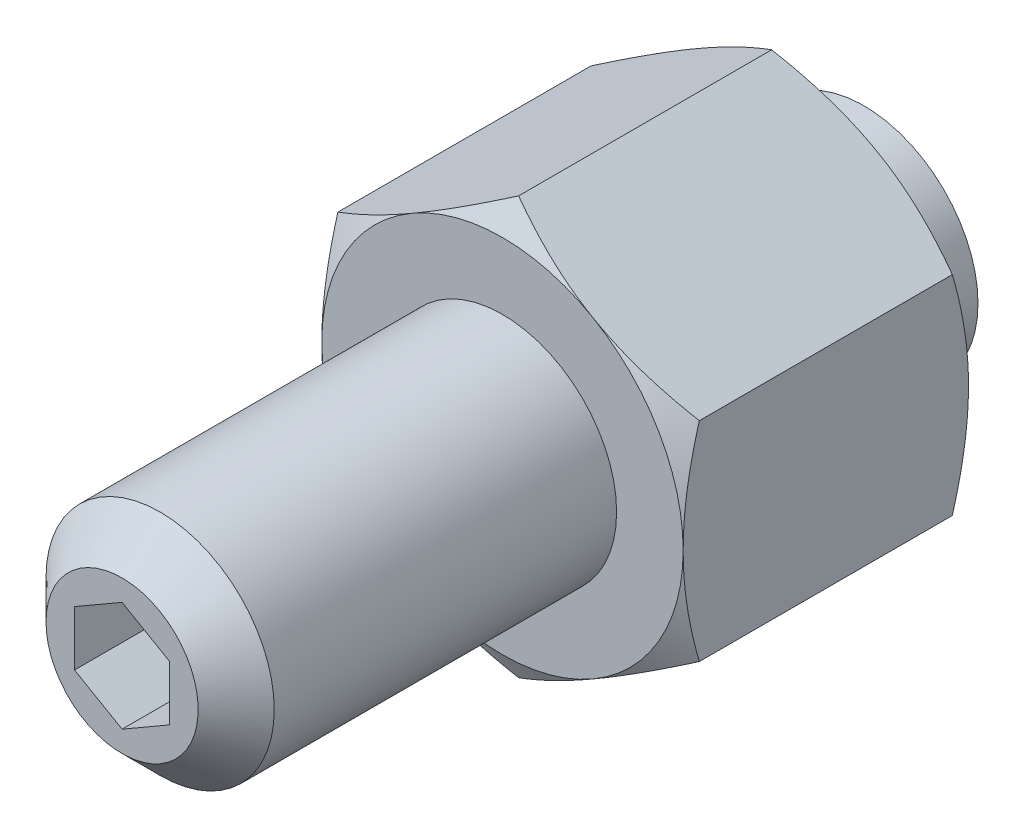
ISO-10303-21;
HEADER;
FILE_DESCRIPTION(('STEP AP214'),'2;1');
FILE_NAME('part.step','',(''),(''),'','','');
FILE_SCHEMA(('AUTOMOTIVE_DESIGN { 1 0 10303 214 1 1 1 1 }'));
ENDSEC;
DATA;
#1=APPLICATION_CONTEXT('core data for automotive mechanical design processes');
#2=APPLICATION_PROTOCOL_DEFINITION('international standard','automotive_design',2000,#1);
#3=PRODUCT_CONTEXT('',#1,'mechanical');
#4=PRODUCT('Part','Part','',(#3));
#5=PRODUCT_RELATED_PRODUCT_CATEGORY('part','',(#4));
#6=PRODUCT_DEFINITION_FORMATION('','',#4);
#7=PRODUCT_DEFINITION_CONTEXT('part definition',#1,'design');
#8=PRODUCT_DEFINITION('design','',#6,#7);
#9=PRODUCT_DEFINITION_SHAPE('','',#8);
#10=(LENGTH_UNIT() NAMED_UNIT(*) SI_UNIT(.MILLI.,.METRE.));
#11=(NAMED_UNIT(*) PLANE_ANGLE_UNIT() SI_UNIT($,.RADIAN.));
#12=(NAMED_UNIT(*) SI_UNIT($,.STERADIAN.) SOLID_ANGLE_UNIT());
#13=UNCERTAINTY_MEASURE_WITH_UNIT(LENGTH_MEASURE(1.E-05),#10,'distance_accuracy_value','');
#14=(GEOMETRIC_REPRESENTATION_CONTEXT(3) GLOBAL_UNCERTAINTY_ASSIGNED_CONTEXT((#13)) GLOBAL_UNIT_ASSIGNED_CONTEXT((#10,
#11,#12)) REPRESENTATION_CONTEXT('',''));
#15=CARTESIAN_POINT('',(0.,0.,0.));
#16=DIRECTION('',(0.,0.,1.));
#17=DIRECTION('',(1.,0.,0.));
#18=AXIS2_PLACEMENT_3D('',#15,#16,#17);
#19=CARTESIAN_POINT('',(0.,-10.9696551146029,19.));
#20=DIRECTION('',(-0.5,-0.866025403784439,0.));
#21=DIRECTION('',(-0.866025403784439,0.5,0.));
#22=AXIS2_PLACEMENT_3D('',#19,#20,#21);
#23=PLANE('',#22);
#24=DIRECTION('',(0.,0.,-1.));
#25=VECTOR('',#24,1.);
#26=CARTESIAN_POINT('',(-9.5,-5.48482755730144,19.));
#27=LINE('',#26,#25);
#28=CARTESIAN_POINT('',(-9.5,-5.48482755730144,18.1514942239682));
#29=VERTEX_POINT('',#28);
#30=CARTESIAN_POINT('',(-9.5,-5.48482755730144,4.84850577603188));
#31=VERTEX_POINT('',#30);
#32=EDGE_CURVE('E170',#29,#31,#27,.T.);
#33=ORIENTED_EDGE('',*,*,#32,.T.);
#34=CARTESIAN_POINT('',(-9.5002,-5.48471208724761,4.84857244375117));
#35=CARTESIAN_POINT('',(-9.2913692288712,-5.6052805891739,4.77897343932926));
#36=CARTESIAN_POINT('',(-9.08175982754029,-5.72629863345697,4.71253330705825));
#37=CARTESIAN_POINT('',(-8.66086011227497,-5.96930519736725,4.58684728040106));
#38=CARTESIAN_POINT('',(-8.44956926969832,-6.09129402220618,4.52760375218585));
#39=CARTESIAN_POINT('',(-7.81229220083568,-6.45922610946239,4.3618145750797));
#40=CARTESIAN_POINT('',(-7.38379023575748,-6.70662183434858,4.26751444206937));
#41=CARTESIAN_POINT('',(-6.74255666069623,-7.07683821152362,4.15693870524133));
#42=CARTESIAN_POINT('',(-6.53174078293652,-7.19855281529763,4.12543982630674));
#43=CARTESIAN_POINT('',(-6.10913296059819,-7.44254555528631,4.07261820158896));
#44=CARTESIAN_POINT('',(-5.89734099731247,-7.56482370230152,4.05129565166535));
#45=CARTESIAN_POINT('',(-5.47340378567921,-7.80958396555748,4.01937302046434));
#46=CARTESIAN_POINT('',(-5.26125925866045,-7.93206566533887,4.00876019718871));
#47=CARTESIAN_POINT('',(-4.83677424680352,-8.17714220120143,3.99848253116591));
#48=CARTESIAN_POINT('',(-4.62443376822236,-8.29973703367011,3.99881735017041));
#49=CARTESIAN_POINT('',(-4.22745800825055,-8.5289310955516,4.00967336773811));
#50=CARTESIAN_POINT('',(-4.04279470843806,-8.63554650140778,4.01887026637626));
#51=CARTESIAN_POINT('',(-3.67389999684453,-8.84852796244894,4.04536539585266));
#52=CARTESIAN_POINT('',(-3.48966861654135,-8.95489399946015,4.06266419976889));
#53=CARTESIAN_POINT('',(-2.93768832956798,-9.27357996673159,4.12630448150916));
#54=CARTESIAN_POINT('',(-2.57091646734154,-9.48533580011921,4.18438190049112));
#55=CARTESIAN_POINT('',(-1.83348217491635,-9.91109368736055,4.32957601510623));
#56=CARTESIAN_POINT('',(-1.46291385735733,-10.1250414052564,4.41730816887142));
#57=CARTESIAN_POINT('',(-0.727303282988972,-10.5497463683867,4.61642373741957));
#58=CARTESIAN_POINT('',(-0.362251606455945,-10.7605090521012,4.72776038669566));
#59=CARTESIAN_POINT('',(0.000200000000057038,-10.9697705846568,4.84857244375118));
#60=B_SPLINE_CURVE_WITH_KNOTS('',3,(#34,#35,#36,#37,#38,#39,#40,#41,#42,#43,#44,#45,#46,#47,#48,
#49,#50,#51,#52,#53,#54,#55,#56,#57,#58,#59),.UNSPECIFIED.,.F.,.F.,(4,2,2,2,2,2,2,2,2,2,2,2,4),
(0.,0.752880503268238,1.50600787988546,3.0154687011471,3.75167336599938,4.48789219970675,
5.22323407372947,5.95855322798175,6.59868084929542,7.23885375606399,8.52010929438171,
9.829780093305,11.1368800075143),.UNSPECIFIED.);
#61=CARTESIAN_POINT('',(-4.75,-8.22724133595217,4.));
#62=VERTEX_POINT('',#61);
#63=EDGE_CURVE('E149',#31,#62,#60,.T.);
#64=ORIENTED_EDGE('',*,*,#63,.T.);
#65=CARTESIAN_POINT('',(0.,-10.9696551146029,4.8485057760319));
#66=VERTEX_POINT('',#65);
#67=EDGE_CURVE('E160',#62,#66,#60,.T.);
#68=ORIENTED_EDGE('',*,*,#67,.T.);
#69=DIRECTION('',(0.,0.,-1.));
#70=VECTOR('',#69,1.);
#71=CARTESIAN_POINT('',(0.,-10.9696551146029,19.));
#72=LINE('',#71,#70);
#73=CARTESIAN_POINT('',(0.,-10.9696551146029,18.1514942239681));
#74=VERTEX_POINT('',#73);
#75=EDGE_CURVE('E349',#74,#66,#72,.T.);
#76=ORIENTED_EDGE('',*,*,#75,.F.);
#77=CARTESIAN_POINT('',(0.000200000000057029,-10.9697705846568,18.1514275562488));
#78=CARTESIAN_POINT('',(-0.208630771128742,-10.8492020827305,18.2210265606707));
#79=CARTESIAN_POINT('',(-0.41824017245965,-10.7281840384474,18.2874666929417));
#80=CARTESIAN_POINT('',(-0.839139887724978,-10.4851774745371,18.4131527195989));
#81=CARTESIAN_POINT('',(-1.05043073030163,-10.3631886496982,18.4723962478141));
#82=CARTESIAN_POINT('',(-1.68770779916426,-9.99525656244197,18.6381854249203));
#83=CARTESIAN_POINT('',(-2.11620976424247,-9.74786083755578,18.7324855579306));
#84=CARTESIAN_POINT('',(-2.75744333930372,-9.37764446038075,18.8430612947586));
#85=CARTESIAN_POINT('',(-2.96825921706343,-9.25592985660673,18.8745601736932));
#86=CARTESIAN_POINT('',(-3.39086703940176,-9.01193711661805,18.927381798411));
#87=CARTESIAN_POINT('',(-3.60265900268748,-8.88965896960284,18.9487043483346));
#88=CARTESIAN_POINT('',(-4.02659621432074,-8.64489870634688,18.9806269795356));
#89=CARTESIAN_POINT('',(-4.23874074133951,-8.52241700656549,18.9912398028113));
#90=CARTESIAN_POINT('',(-4.66322575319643,-8.27734047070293,19.0015174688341));
#91=CARTESIAN_POINT('',(-4.87556623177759,-8.15474563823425,19.0011826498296));
#92=CARTESIAN_POINT('',(-5.2725419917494,-7.92555157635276,18.9903266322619));
#93=CARTESIAN_POINT('',(-5.45720529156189,-7.81893617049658,18.9811297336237));
#94=CARTESIAN_POINT('',(-5.82610000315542,-7.60595470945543,18.9546346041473));
#95=CARTESIAN_POINT('',(-6.0103313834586,-7.49958867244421,18.9373358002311));
#96=CARTESIAN_POINT('',(-6.56231167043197,-7.18090270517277,18.8736955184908));
#97=CARTESIAN_POINT('',(-6.92908353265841,-6.96914687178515,18.8156180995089));
#98=CARTESIAN_POINT('',(-7.66651782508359,-6.54338898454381,18.6704239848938));
#99=CARTESIAN_POINT('',(-8.03708614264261,-6.32944126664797,18.5826918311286));
#100=CARTESIAN_POINT('',(-8.77269671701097,-5.90473630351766,18.3835762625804));
#101=CARTESIAN_POINT('',(-9.137748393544,-5.69397361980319,18.2722396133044));
#102=CARTESIAN_POINT('',(-9.5002,-5.4847120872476,18.1514275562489));
#103=B_SPLINE_CURVE_WITH_KNOTS('',3,(#77,#78,#79,#80,#81,#82,#83,#84,#85,#86,#87,#88,#89,#90,
#91,#92,#93,#94,#95,#96,#97,#98,#99,#100,#101,#102),.UNSPECIFIED.,.F.,.F.,(4,2,2,2,2,2,2,2,2,2,
2,2,4),(0.,0.752880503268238,1.50600787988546,3.0154687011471,3.75167336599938,4.48789219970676,
5.22323407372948,5.95855322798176,6.59868084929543,7.23885375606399,8.52010929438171,
9.829780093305,11.1368800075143),.UNSPECIFIED.);
#104=CARTESIAN_POINT('',(-4.75,-8.22724133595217,19.));
#105=VERTEX_POINT('',#104);
#106=EDGE_CURVE('E347',#74,#105,#103,.T.);
#107=ORIENTED_EDGE('',*,*,#106,.T.);
#108=EDGE_CURVE('E235',#105,#29,#103,.T.);
#109=ORIENTED_EDGE('',*,*,#108,.T.);
#110=EDGE_LOOP('',(#33,#64,#68,#76,#107,#109));
#111=FACE_BOUND('',#110,.T.);
#112=ADVANCED_FACE('F14',(#111),#23,.T.);
#113=CARTESIAN_POINT('',(-9.5,-5.48482755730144,19.));
#114=DIRECTION('',(-1.,0.,0.));
#115=DIRECTION('',(0.,0.,-1.));
#116=AXIS2_PLACEMENT_3D('',#113,#114,#115);
#117=PLANE('',#116);
#118=DIRECTION('',(0.,0.,-1.));
#119=VECTOR('',#118,1.);
#120=CARTESIAN_POINT('',(-9.5,5.48482755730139,19.));
#121=LINE('',#120,#119);
#122=CARTESIAN_POINT('',(-9.5,5.48482755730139,18.1514942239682));
#123=VERTEX_POINT('',#122);
#124=CARTESIAN_POINT('',(-9.5,5.48482755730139,4.84850577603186));
#125=VERTEX_POINT('',#124);
#126=EDGE_CURVE('E306',#123,#125,#121,.T.);
#127=ORIENTED_EDGE('',*,*,#126,.T.);
#128=CARTESIAN_POINT('',(-9.5,-14.7052692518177,8.62284187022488));
#129=CARTESIAN_POINT('',(-9.5,-14.4979323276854,8.5222949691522));
#130=CARTESIAN_POINT('',(-9.5,-14.2903513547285,8.42225155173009));
#131=CARTESIAN_POINT('',(-9.5,-13.8746503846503,8.22328577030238));
#132=CARTESIAN_POINT('',(-9.5,-13.6665303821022,8.12436341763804));
#133=CARTESIAN_POINT('',(-9.5,-13.0412296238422,7.82942282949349));
#134=CARTESIAN_POINT('',(-9.5,-12.6231698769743,7.63526109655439));
#135=CARTESIAN_POINT('',(-9.5,-11.7819549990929,7.25201631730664));
#136=CARTESIAN_POINT('',(-9.5,-11.3587845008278,7.06296691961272));
#137=CARTESIAN_POINT('',(-9.5,-10.5090688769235,6.69263841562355));
#138=CARTESIAN_POINT('',(-9.5,-10.0825239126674,6.51135894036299));
#139=CARTESIAN_POINT('',(-9.5,-9.2117024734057,6.15299881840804));
#140=CARTESIAN_POINT('',(-9.5,-8.76729431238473,5.97623640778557));
#141=CARTESIAN_POINT('',(-9.5,-7.87326958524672,5.63615642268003));
#142=CARTESIAN_POINT('',(-9.5,-7.4236524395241,5.47284036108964));
#143=CARTESIAN_POINT('',(-9.5,-6.5193395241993,5.16396162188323));
#144=CARTESIAN_POINT('',(-9.5,-6.0646562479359,5.018362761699));
#145=CARTESIAN_POINT('',(-9.5,-5.14878395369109,4.74960672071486));
#146=CARTESIAN_POINT('',(-9.5,-4.68759704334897,4.62644244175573));
#147=CARTESIAN_POINT('',(-9.5,-3.76094214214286,4.40914857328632));
#148=CARTESIAN_POINT('',(-9.5,-3.29551197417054,4.31486205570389));
#149=CARTESIAN_POINT('',(-9.5,-2.59315047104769,4.19918433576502));
#150=CARTESIAN_POINT('',(-9.5,-2.35830976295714,4.16491552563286));
#151=CARTESIAN_POINT('',(-9.5,-1.88747047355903,4.10563472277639));
#152=CARTESIAN_POINT('',(-9.5,-1.65147200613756,4.08062183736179));
#153=CARTESIAN_POINT('',(-9.5,-1.18170383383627,4.04066343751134));
#154=CARTESIAN_POINT('',(-9.5,-0.947944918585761,4.0255915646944));
#155=CARTESIAN_POINT('',(-9.5,-0.479999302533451,4.00534458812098));
#156=CARTESIAN_POINT('',(-9.5,-0.245812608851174,4.00016932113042));
#157=CARTESIAN_POINT('',(-9.5,0.222570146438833,3.99983888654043));
#158=CARTESIAN_POINT('',(-9.5,0.456766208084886,4.00468376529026));
#159=CARTESIAN_POINT('',(-9.5,0.924746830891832,4.02427585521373));
#160=CARTESIAN_POINT('',(-9.5,1.15853137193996,4.03902353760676));
#161=CARTESIAN_POINT('',(-9.5,1.72123885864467,4.08612689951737));
#162=CARTESIAN_POINT('',(-9.5,2.0497714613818,4.12322833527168));
#163=CARTESIAN_POINT('',(-9.5,2.7043820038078,4.21496006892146));
#164=CARTESIAN_POINT('',(-9.5,3.03045960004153,4.26959277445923));
#165=CARTESIAN_POINT('',(-9.5,3.67985528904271,4.39444349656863));
#166=CARTESIAN_POINT('',(-9.5,4.00317100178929,4.46467377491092));
#167=CARTESIAN_POINT('',(-9.5,4.64655103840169,4.61857797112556));
#168=CARTESIAN_POINT('',(-9.5,4.96661541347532,4.70225167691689));
#169=CARTESIAN_POINT('',(-9.5,5.61049207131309,4.88297492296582));
#170=CARTESIAN_POINT('',(-9.5,5.93423289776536,4.98027729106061));
#171=CARTESIAN_POINT('',(-9.5,6.57852512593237,5.18487013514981));
#172=CARTESIAN_POINT('',(-9.5,6.8990765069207,5.29216067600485));
#173=CARTESIAN_POINT('',(-9.5,7.53714918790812,5.51503208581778));
#174=CARTESIAN_POINT('',(-9.5,7.85467147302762,5.63061014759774));
#175=CARTESIAN_POINT('',(-9.5,8.48708958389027,5.86870330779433));
#176=CARTESIAN_POINT('',(-9.5,8.80198543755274,5.99121833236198));
#177=CARTESIAN_POINT('',(-9.5,9.53323282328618,6.28351966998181));
#178=CARTESIAN_POINT('',(-9.5,9.94869078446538,6.45553778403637));
#179=CARTESIAN_POINT('',(-9.5,10.7761623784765,6.80769079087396));
#180=CARTESIAN_POINT('',(-9.5,11.1881758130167,6.98782614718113));
#181=CARTESIAN_POINT('',(-9.5,12.0093834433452,7.35462197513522));
#182=CARTESIAN_POINT('',(-9.5,12.4185770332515,7.54128379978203));
#183=CARTESIAN_POINT('',(-9.5,13.2345188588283,7.9198444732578));
#184=CARTESIAN_POINT('',(-9.5,13.6412671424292,8.11174321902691));
#185=CARTESIAN_POINT('',(-9.5,14.4531381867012,8.50001811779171));
#186=CARTESIAN_POINT('',(-9.5,14.8582588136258,8.6963987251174));
#187=CARTESIAN_POINT('',(-9.5,15.666765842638,9.09269636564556));
#188=CARTESIAN_POINT('',(-9.5,16.0701522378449,9.29261341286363));
#189=CARTESIAN_POINT('',(-9.5,17.2780198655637,9.89669781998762));
#190=CARTESIAN_POINT('',(-9.5,18.0803096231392,10.3052466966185));
#191=CARTESIAN_POINT('',(-9.5,19.6154026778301,11.0969791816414));
#192=CARTESIAN_POINT('',(-9.5,20.3485406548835,11.4795167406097));
#193=CARTESIAN_POINT('',(-9.5,21.812066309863,12.2498716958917));
#194=CARTESIAN_POINT('',(-9.5,22.5424538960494,12.6376892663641));
#195=CARTESIAN_POINT('',(-9.5,23.9993281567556,13.4164244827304));
#196=CARTESIAN_POINT('',(-9.5,24.7258199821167,13.807332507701));
#197=CARTESIAN_POINT('',(-9.5,26.1770376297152,14.5923228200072));
#198=CARTESIAN_POINT('',(-9.5,26.9017635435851,14.9864049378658));
#199=CARTESIAN_POINT('',(-9.5,27.6258360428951,15.3816759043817));
#200=B_SPLINE_CURVE_WITH_KNOTS('',3,(#128,#129,#130,#131,#132,#133,#134,#135,#136,#137,#138,
#139,#140,#141,#142,#143,#144,#145,#146,#147,#148,#149,#150,#151,#152,#153,#154,#155,#156,#157,
#158,#159,#160,#161,#162,#163,#164,#165,#166,#167,#168,#169,#170,#171,#172,#173,#174,#175,#176,
#177,#178,#179,#180,#181,#182,#183,#184,#185,#186,#187,#188,#189,#190,#191,#192,#193,#194,#195,
#196,#197,#198,#199),.UNSPECIFIED.,.F.,.F.,(4,2,2,2,2,2,2,2,2,2,2,2,2,2,2,2,2,2,2,2,2,2,2,2,2,2,
2,2,2,2,2,2,2,2,2,4),(0.,0.691290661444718,1.38258831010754,2.76538961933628,4.15576611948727,
5.54607652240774,6.98072209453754,8.41552886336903,9.84735441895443,11.2787261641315,
12.7021755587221,13.4140053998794,14.1257665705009,14.8282967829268,15.5308154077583,
16.2333372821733,16.9358925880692,17.9272061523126,18.918655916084,19.9108878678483,
20.9031041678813,21.9170528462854,22.9310081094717,23.944621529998,24.9582241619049,
26.3070931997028,27.6560393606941,29.0052668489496,30.3544678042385,31.7050737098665,
33.0556849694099,35.7565742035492,38.2373648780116,40.7182375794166,43.1931827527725,
45.6679966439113),.UNSPECIFIED.);
#201=CARTESIAN_POINT('',(-9.5,0.,4.));
#202=VERTEX_POINT('',#201);
#203=EDGE_CURVE('E289',#125,#202,#200,.F.);
#204=ORIENTED_EDGE('',*,*,#203,.T.);
#205=EDGE_CURVE('E151',#202,#31,#200,.F.);
#206=ORIENTED_EDGE('',*,*,#205,.T.);
#207=ORIENTED_EDGE('',*,*,#32,.F.);
#208=CARTESIAN_POINT('',(-9.5,-14.7052692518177,14.3771581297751));
#209=CARTESIAN_POINT('',(-9.5,-14.4979323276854,14.4777050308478));
#210=CARTESIAN_POINT('',(-9.5,-14.2903513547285,14.5777484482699));
#211=CARTESIAN_POINT('',(-9.5,-13.8746503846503,14.7767142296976));
#212=CARTESIAN_POINT('',(-9.5,-13.6665303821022,14.8756365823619));
#213=CARTESIAN_POINT('',(-9.5,-13.0412296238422,15.1705771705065));
#214=CARTESIAN_POINT('',(-9.5,-12.6231698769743,15.3647389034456));
#215=CARTESIAN_POINT('',(-9.5,-11.7819549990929,15.7479836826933));
#216=CARTESIAN_POINT('',(-9.5,-11.3587845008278,15.9370330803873));
#217=CARTESIAN_POINT('',(-9.5,-10.5090688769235,16.3073615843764));
#218=CARTESIAN_POINT('',(-9.5,-10.0825239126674,16.488641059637));
#219=CARTESIAN_POINT('',(-9.5,-9.21170247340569,16.8470011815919));
#220=CARTESIAN_POINT('',(-9.5,-8.76729431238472,17.0237635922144));
#221=CARTESIAN_POINT('',(-9.5,-7.87326958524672,17.36384357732));
#222=CARTESIAN_POINT('',(-9.5,-7.4236524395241,17.5271596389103));
#223=CARTESIAN_POINT('',(-9.5,-6.51933952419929,17.8360383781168));
#224=CARTESIAN_POINT('',(-9.5,-6.06465624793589,17.981637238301));
#225=CARTESIAN_POINT('',(-9.5,-5.14878395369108,18.2503932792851));
#226=CARTESIAN_POINT('',(-9.5,-4.68759704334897,18.3735575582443));
#227=CARTESIAN_POINT('',(-9.5,-3.76094214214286,18.5908514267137));
#228=CARTESIAN_POINT('',(-9.5,-3.29551197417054,18.6851379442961));
#229=CARTESIAN_POINT('',(-9.5,-2.59315047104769,18.800815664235));
#230=CARTESIAN_POINT('',(-9.5,-2.35830976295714,18.8350844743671));
#231=CARTESIAN_POINT('',(-9.5,-1.88747047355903,18.8943652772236));
#232=CARTESIAN_POINT('',(-9.5,-1.65147200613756,18.9193781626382));
#233=CARTESIAN_POINT('',(-9.5,-1.18170383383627,18.9593365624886));
#234=CARTESIAN_POINT('',(-9.5,-0.947944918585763,18.9744084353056));
#235=CARTESIAN_POINT('',(-9.5,-0.479999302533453,18.994655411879));
#236=CARTESIAN_POINT('',(-9.5,-0.245812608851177,18.9998306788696));
#237=CARTESIAN_POINT('',(-9.5,0.22257014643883,19.0001611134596));
#238=CARTESIAN_POINT('',(-9.5,0.456766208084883,18.9953162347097));
#239=CARTESIAN_POINT('',(-9.5,0.924746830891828,18.9757241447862));
#240=CARTESIAN_POINT('',(-9.5,1.15853137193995,18.9609764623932));
#241=CARTESIAN_POINT('',(-9.5,1.72123885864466,18.9138731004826));
#242=CARTESIAN_POINT('',(-9.5,2.0497714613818,18.8767716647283));
#243=CARTESIAN_POINT('',(-9.5,2.70438200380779,18.7850399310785));
#244=CARTESIAN_POINT('',(-9.5,3.03045960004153,18.7304072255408));
#245=CARTESIAN_POINT('',(-9.5,3.6798552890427,18.6055565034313));
#246=CARTESIAN_POINT('',(-9.5,4.00317100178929,18.5353262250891));
#247=CARTESIAN_POINT('',(-9.5,4.64655103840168,18.3814220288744));
#248=CARTESIAN_POINT('',(-9.5,4.96661541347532,18.2977483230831));
#249=CARTESIAN_POINT('',(-9.5,5.61049207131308,18.1170250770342));
#250=CARTESIAN_POINT('',(-9.5,5.93423289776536,18.0197227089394));
#251=CARTESIAN_POINT('',(-9.5,6.57852512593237,17.8151298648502));
#252=CARTESIAN_POINT('',(-9.5,6.89907650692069,17.7078393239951));
#253=CARTESIAN_POINT('',(-9.5,7.53714918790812,17.4849679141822));
#254=CARTESIAN_POINT('',(-9.5,7.85467147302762,17.3693898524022));
#255=CARTESIAN_POINT('',(-9.5,8.48708958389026,17.1312966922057));
#256=CARTESIAN_POINT('',(-9.5,8.80198543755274,17.008781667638));
#257=CARTESIAN_POINT('',(-9.5,9.53323282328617,16.7164803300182));
#258=CARTESIAN_POINT('',(-9.5,9.94869078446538,16.5444622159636));
#259=CARTESIAN_POINT('',(-9.5,10.7761623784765,16.192309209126));
#260=CARTESIAN_POINT('',(-9.5,11.1881758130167,16.0121738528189));
#261=CARTESIAN_POINT('',(-9.5,12.0093834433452,15.6453780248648));
#262=CARTESIAN_POINT('',(-9.5,12.4185770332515,15.458716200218));
#263=CARTESIAN_POINT('',(-9.5,13.2345188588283,15.0801555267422));
#264=CARTESIAN_POINT('',(-9.5,13.6412671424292,14.8882567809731));
#265=CARTESIAN_POINT('',(-9.5,14.4531381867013,14.4999818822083));
#266=CARTESIAN_POINT('',(-9.5,14.8582588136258,14.3036012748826));
#267=CARTESIAN_POINT('',(-9.5,15.666765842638,13.9073036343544));
#268=CARTESIAN_POINT('',(-9.5,16.0701522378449,13.7073865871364));
#269=CARTESIAN_POINT('',(-9.5,17.2780198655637,13.1033021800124));
#270=CARTESIAN_POINT('',(-9.5,18.0803096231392,12.6947533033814));
#271=CARTESIAN_POINT('',(-9.5,19.6154026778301,11.9030208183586));
#272=CARTESIAN_POINT('',(-9.5,20.3485406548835,11.5204832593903));
#273=CARTESIAN_POINT('',(-9.5,21.812066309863,10.7501283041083));
#274=CARTESIAN_POINT('',(-9.5,22.5424538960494,10.3623107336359));
#275=CARTESIAN_POINT('',(-9.5,23.9993281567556,9.58357551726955));
#276=CARTESIAN_POINT('',(-9.5,24.7258199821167,9.19266749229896));
#277=CARTESIAN_POINT('',(-9.5,26.1770376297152,8.40767717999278));
#278=CARTESIAN_POINT('',(-9.5,26.9017635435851,8.01359506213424));
#279=CARTESIAN_POINT('',(-9.5,27.6258360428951,7.6183240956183));
#280=B_SPLINE_CURVE_WITH_KNOTS('',3,(#208,#209,#210,#211,#212,#213,#214,#215,#216,#217,#218,
#219,#220,#221,#222,#223,#224,#225,#226,#227,#228,#229,#230,#231,#232,#233,#234,#235,#236,#237,
#238,#239,#240,#241,#242,#243,#244,#245,#246,#247,#248,#249,#250,#251,#252,#253,#254,#255,#256,
#257,#258,#259,#260,#261,#262,#263,#264,#265,#266,#267,#268,#269,#270,#271,#272,#273,#274,#275,
#276,#277,#278,#279),.UNSPECIFIED.,.F.,.F.,(4,2,2,2,2,2,2,2,2,2,2,2,2,2,2,2,2,2,2,2,2,2,2,2,2,2,
2,2,2,2,2,2,2,2,2,4),(0.,0.691290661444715,1.38258831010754,2.76538961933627,4.15576611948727,
5.54607652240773,6.98072209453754,8.41552886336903,9.84735441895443,11.2787261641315,
12.7021755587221,13.4140053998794,14.1257665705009,14.8282967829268,15.5308154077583,
16.2333372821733,16.9358925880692,17.9272061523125,18.918655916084,19.9108878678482,
20.9031041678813,21.9170528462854,22.9310081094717,23.944621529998,24.9582241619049,
26.3070931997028,27.6560393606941,29.0052668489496,30.3544678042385,31.7050737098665,
33.0556849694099,35.7565742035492,38.2373648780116,40.7182375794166,43.1931827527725,
45.6679966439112),.UNSPECIFIED.);
#281=CARTESIAN_POINT('',(-9.5,0.,19.));
#282=VERTEX_POINT('',#281);
#283=EDGE_CURVE('E245',#29,#282,#280,.T.);
#284=ORIENTED_EDGE('',*,*,#283,.T.);
#285=EDGE_CURVE('E265',#282,#123,#280,.T.);
#286=ORIENTED_EDGE('',*,*,#285,.T.);
#287=EDGE_LOOP('',(#127,#204,#206,#207,#284,#286));
#288=FACE_BOUND('',#287,.T.);
#289=ADVANCED_FACE('F269',(#288),#117,.T.);
#290=CARTESIAN_POINT('',(0.,10.9696551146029,19.));
#291=DIRECTION('',(0.500000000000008,-0.866025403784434,0.));
#292=DIRECTION('',(-0.866025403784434,-0.500000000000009,0.));
#293=AXIS2_PLACEMENT_3D('',#290,#291,#292);
#294=PLANE('',#293);
#295=CARTESIAN_POINT('',(-9.5002,5.48471208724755,4.84857244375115));
#296=CARTESIAN_POINT('',(-9.2913692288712,5.60528058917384,4.77897343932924));
#297=CARTESIAN_POINT('',(-9.0817598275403,5.72629863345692,4.71253330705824));
#298=CARTESIAN_POINT('',(-8.66086011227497,5.9693051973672,4.58684728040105));
#299=CARTESIAN_POINT('',(-8.44956926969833,6.09129402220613,4.52760375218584));
#300=CARTESIAN_POINT('',(-7.8122922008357,6.45922610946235,4.36181457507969));
#301=CARTESIAN_POINT('',(-7.38379023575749,6.70662183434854,4.26751444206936));
#302=CARTESIAN_POINT('',(-6.74255666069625,7.07683821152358,4.15693870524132));
#303=CARTESIAN_POINT('',(-6.53174078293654,7.19855281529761,4.12543982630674));
#304=CARTESIAN_POINT('',(-6.10913296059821,7.44254555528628,4.07261820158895));
#305=CARTESIAN_POINT('',(-5.89734099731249,7.5648237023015,4.05129565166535));
#306=CARTESIAN_POINT('',(-5.47340378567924,7.80958396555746,4.01937302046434));
#307=CARTESIAN_POINT('',(-5.26125925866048,7.93206566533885,4.00876019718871));
#308=CARTESIAN_POINT('',(-4.83677424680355,8.17714220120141,3.99848253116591));
#309=CARTESIAN_POINT('',(-4.6244337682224,8.2997370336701,3.99881735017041));
#310=CARTESIAN_POINT('',(-4.22745800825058,8.52893109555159,4.00967336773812));
#311=CARTESIAN_POINT('',(-4.0427947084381,8.63554650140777,4.01887026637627));
#312=CARTESIAN_POINT('',(-3.67389999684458,8.84852796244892,4.04536539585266));
#313=CARTESIAN_POINT('',(-3.4896686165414,8.95489399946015,4.0626641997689));
#314=CARTESIAN_POINT('',(-2.93768832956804,9.27357996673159,4.12630448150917));
#315=CARTESIAN_POINT('',(-2.57091646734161,9.4853358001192,4.18438190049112));
#316=CARTESIAN_POINT('',(-1.83348217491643,9.91109368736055,4.32957601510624));
#317=CARTESIAN_POINT('',(-1.46291385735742,10.1250414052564,4.41730816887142));
#318=CARTESIAN_POINT('',(-0.727303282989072,10.5497463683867,4.61642373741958));
#319=CARTESIAN_POINT('',(-0.362251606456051,10.7605090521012,4.72776038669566));
#320=CARTESIAN_POINT('',(0.000199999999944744,10.9697705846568,4.84857244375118));
#321=B_SPLINE_CURVE_WITH_KNOTS('',3,(#295,#296,#297,#298,#299,#300,#301,#302,#303,#304,#305,
#306,#307,#308,#309,#310,#311,#312,#313,#314,#315,#316,#317,#318,#319,#320),.UNSPECIFIED.,.F.,
.F.,(4,2,2,2,2,2,2,2,2,2,2,2,4),(0.,0.752880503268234,1.50600787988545,3.01546870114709,
3.75167336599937,4.48789219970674,5.22323407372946,5.95855322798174,6.5986808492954,
7.23885375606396,8.52010929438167,9.82978009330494,11.1368800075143),.UNSPECIFIED.);
#322=CARTESIAN_POINT('',(-4.75000000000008,8.22724133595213,4.));
#323=VERTEX_POINT('',#322);
#324=EDGE_CURVE('E280',#125,#323,#321,.T.);
#325=ORIENTED_EDGE('',*,*,#324,.F.);
#326=ORIENTED_EDGE('',*,*,#126,.F.);
#327=CARTESIAN_POINT('',(0.000199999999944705,10.9697705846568,18.1514275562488));
#328=CARTESIAN_POINT('',(-0.208630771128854,10.8492020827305,18.2210265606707));
#329=CARTESIAN_POINT('',(-0.418240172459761,10.7281840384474,18.2874666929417));
#330=CARTESIAN_POINT('',(-0.839139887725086,10.4851774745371,18.4131527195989));
#331=CARTESIAN_POINT('',(-1.05043073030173,10.3631886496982,18.4723962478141));
#332=CARTESIAN_POINT('',(-1.68770779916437,9.99525656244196,18.6381854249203));
#333=CARTESIAN_POINT('',(-2.11620976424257,9.74786083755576,18.7324855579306));
#334=CARTESIAN_POINT('',(-2.75744333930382,9.37764446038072,18.8430612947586));
#335=CARTESIAN_POINT('',(-2.96825921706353,9.2559298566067,18.8745601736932));
#336=CARTESIAN_POINT('',(-3.39086703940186,9.01193711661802,18.927381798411));
#337=CARTESIAN_POINT('',(-3.60265900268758,8.8896589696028,18.9487043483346));
#338=CARTESIAN_POINT('',(-4.02659621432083,8.64489870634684,18.9806269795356));
#339=CARTESIAN_POINT('',(-4.2387407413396,8.52241700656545,18.9912398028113));
#340=CARTESIAN_POINT('',(-4.66322575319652,8.27734047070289,19.0015174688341));
#341=CARTESIAN_POINT('',(-4.87556623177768,8.1547456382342,19.0011826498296));
#342=CARTESIAN_POINT('',(-5.27254199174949,7.92555157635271,18.9903266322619));
#343=CARTESIAN_POINT('',(-5.45720529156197,7.81893617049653,18.9811297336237));
#344=CARTESIAN_POINT('',(-5.82610000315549,7.60595470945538,18.9546346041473));
#345=CARTESIAN_POINT('',(-6.01033138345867,7.49958867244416,18.9373358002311));
#346=CARTESIAN_POINT('',(-6.56231167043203,7.18090270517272,18.8736955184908));
#347=CARTESIAN_POINT('',(-6.92908353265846,6.9691468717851,18.8156180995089));
#348=CARTESIAN_POINT('',(-7.66651782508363,6.54338898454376,18.6704239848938));
#349=CARTESIAN_POINT('',(-8.03708614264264,6.32944126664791,18.5826918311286));
#350=CARTESIAN_POINT('',(-8.77269671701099,5.90473630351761,18.3835762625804));
#351=CARTESIAN_POINT('',(-9.13774839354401,5.69397361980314,18.2722396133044));
#352=CARTESIAN_POINT('',(-9.5002,5.48471208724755,18.1514275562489));
#353=B_SPLINE_CURVE_WITH_KNOTS('',3,(#327,#328,#329,#330,#331,#332,#333,#334,#335,#336,#337,
#338,#339,#340,#341,#342,#343,#344,#345,#346,#347,#348,#349,#350,#351,#352),.UNSPECIFIED.,.F.,
.F.,(4,2,2,2,2,2,2,2,2,2,2,2,4),(0.,0.752880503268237,1.50600787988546,3.01546870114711,
3.75167336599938,4.48789219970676,5.22323407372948,5.95855322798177,6.59868084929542,
7.23885375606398,8.52010929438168,9.82978009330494,11.1368800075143),.UNSPECIFIED.);
#354=CARTESIAN_POINT('',(-4.75000000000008,8.22724133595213,19.));
#355=VERTEX_POINT('',#354);
#356=EDGE_CURVE('E259',#355,#123,#353,.T.);
#357=ORIENTED_EDGE('',*,*,#356,.F.);
#358=CARTESIAN_POINT('',(0.,10.9696551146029,18.1514942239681));
#359=VERTEX_POINT('',#358);
#360=EDGE_CURVE('E264',#359,#355,#353,.T.);
#361=ORIENTED_EDGE('',*,*,#360,.F.);
#362=DIRECTION('',(0.,0.,-1.));
#363=VECTOR('',#362,1.);
#364=CARTESIAN_POINT('',(0.,10.9696551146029,19.));
#365=LINE('',#364,#363);
#366=CARTESIAN_POINT('',(0.,10.9696551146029,4.8485057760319));
#367=VERTEX_POINT('',#366);
#368=EDGE_CURVE('E314',#359,#367,#365,.T.);
#369=ORIENTED_EDGE('',*,*,#368,.T.);
#370=EDGE_CURVE('E274',#323,#367,#321,.T.);
#371=ORIENTED_EDGE('',*,*,#370,.F.);
#372=EDGE_LOOP('',(#325,#326,#357,#361,#369,#371));
#373=FACE_BOUND('',#372,.T.);
#374=ADVANCED_FACE('F266',(#373),#294,.F.);
#375=CARTESIAN_POINT('',(0.,10.9696551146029,19.));
#376=DIRECTION('',(0.5,0.866025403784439,0.));
#377=DIRECTION('',(0.866025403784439,-0.5,0.));
#378=AXIS2_PLACEMENT_3D('',#375,#376,#377);
#379=PLANE('',#378);
#380=DIRECTION('',(0.,0.,-1.));
#381=VECTOR('',#380,1.);
#382=CARTESIAN_POINT('',(9.5,5.48482755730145,19.));
#383=LINE('',#382,#381);
#384=CARTESIAN_POINT('',(9.5,5.48482755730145,18.1514942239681));
#385=VERTEX_POINT('',#384);
#386=CARTESIAN_POINT('',(9.5,5.48482755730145,4.84850577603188));
#387=VERTEX_POINT('',#386);
#388=EDGE_CURVE('E326',#385,#387,#383,.T.);
#389=ORIENTED_EDGE('',*,*,#388,.T.);
#390=CARTESIAN_POINT('',(9.5002,5.48471208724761,4.84857244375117));
#391=CARTESIAN_POINT('',(9.2913692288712,5.6052805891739,4.77897343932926));
#392=CARTESIAN_POINT('',(9.0817598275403,5.72629863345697,4.71253330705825));
#393=CARTESIAN_POINT('',(8.66086011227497,5.96930519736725,4.58684728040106));
#394=CARTESIAN_POINT('',(8.44956926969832,6.09129402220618,4.52760375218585));
#395=CARTESIAN_POINT('',(7.81229220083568,6.45922610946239,4.36181457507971));
#396=CARTESIAN_POINT('',(7.38379023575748,6.70662183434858,4.26751444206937));
#397=CARTESIAN_POINT('',(6.74255666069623,7.07683821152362,4.15693870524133));
#398=CARTESIAN_POINT('',(6.53174078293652,7.19855281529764,4.12543982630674));
#399=CARTESIAN_POINT('',(6.10913296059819,7.44254555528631,4.07261820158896));
#400=CARTESIAN_POINT('',(5.89734099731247,7.56482370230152,4.05129565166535));
#401=CARTESIAN_POINT('',(5.47340378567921,7.80958396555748,4.01937302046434));
#402=CARTESIAN_POINT('',(5.26125925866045,7.93206566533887,4.00876019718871));
#403=CARTESIAN_POINT('',(4.83677424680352,8.17714220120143,3.99848253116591));
#404=CARTESIAN_POINT('',(4.62443376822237,8.29973703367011,3.99881735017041));
#405=CARTESIAN_POINT('',(4.22745800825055,8.5289310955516,4.00967336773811));
#406=CARTESIAN_POINT('',(4.04279470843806,8.63554650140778,4.01887026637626));
#407=CARTESIAN_POINT('',(3.67389999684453,8.84852796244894,4.04536539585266));
#408=CARTESIAN_POINT('',(3.48966861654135,8.95489399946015,4.06266419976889));
#409=CARTESIAN_POINT('',(2.93768832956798,9.27357996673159,4.12630448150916));
#410=CARTESIAN_POINT('',(2.57091646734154,9.48533580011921,4.18438190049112));
#411=CARTESIAN_POINT('',(1.83348217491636,9.91109368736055,4.32957601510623));
#412=CARTESIAN_POINT('',(1.46291385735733,10.1250414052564,4.41730816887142));
#413=CARTESIAN_POINT('',(0.727303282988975,10.5497463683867,4.61642373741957));
#414=CARTESIAN_POINT('',(0.362251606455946,10.7605090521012,4.72776038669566));
#415=CARTESIAN_POINT('',(-0.000200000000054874,10.9697705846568,4.84857244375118));
#416=B_SPLINE_CURVE_WITH_KNOTS('',3,(#390,#391,#392,#393,#394,#395,#396,#397,#398,#399,#400,
#401,#402,#403,#404,#405,#406,#407,#408,#409,#410,#411,#412,#413,#414,#415),.UNSPECIFIED.,.F.,
.F.,(4,2,2,2,2,2,2,2,2,2,2,2,4),(0.,0.752880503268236,1.50600787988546,3.0154687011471,
3.75167336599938,4.48789219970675,5.22323407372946,5.95855322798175,6.59868084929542,
7.23885375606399,8.52010929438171,9.82978009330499,11.1368800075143),.UNSPECIFIED.);
#417=CARTESIAN_POINT('',(4.75,8.22724133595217,4.));
#418=VERTEX_POINT('',#417);
#419=EDGE_CURVE('E165',#387,#418,#416,.T.);
#420=ORIENTED_EDGE('',*,*,#419,.T.);
#421=EDGE_CURVE('E171',#418,#367,#416,.T.);
#422=ORIENTED_EDGE('',*,*,#421,.T.);
#423=ORIENTED_EDGE('',*,*,#368,.F.);
#424=CARTESIAN_POINT('',(-0.000200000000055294,10.9697705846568,18.1514275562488));
#425=CARTESIAN_POINT('',(0.208630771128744,10.8492020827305,18.2210265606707));
#426=CARTESIAN_POINT('',(0.418240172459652,10.7281840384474,18.2874666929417));
#427=CARTESIAN_POINT('',(0.839139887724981,10.4851774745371,18.4131527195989));
#428=CARTESIAN_POINT('',(1.05043073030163,10.3631886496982,18.4723962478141));
#429=CARTESIAN_POINT('',(1.68770779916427,9.99525656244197,18.6381854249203));
#430=CARTESIAN_POINT('',(2.11620976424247,9.74786083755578,18.7324855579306));
#431=CARTESIAN_POINT('',(2.75744333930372,9.37764446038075,18.8430612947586));
#432=CARTESIAN_POINT('',(2.96825921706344,9.25592985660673,18.8745601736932));
#433=CARTESIAN_POINT('',(3.39086703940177,9.01193711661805,18.927381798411));
#434=CARTESIAN_POINT('',(3.60265900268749,8.88965896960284,18.9487043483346));
#435=CARTESIAN_POINT('',(4.02659621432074,8.64489870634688,18.9806269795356));
#436=CARTESIAN_POINT('',(4.23874074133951,8.52241700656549,18.9912398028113));
#437=CARTESIAN_POINT('',(4.66322575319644,8.27734047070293,19.0015174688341));
#438=CARTESIAN_POINT('',(4.8755662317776,8.15474563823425,19.0011826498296));
#439=CARTESIAN_POINT('',(5.27254199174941,7.92555157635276,18.9903266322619));
#440=CARTESIAN_POINT('',(5.4572052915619,7.81893617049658,18.9811297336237));
#441=CARTESIAN_POINT('',(5.82610000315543,7.60595470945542,18.9546346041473));
#442=CARTESIAN_POINT('',(6.01033138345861,7.49958867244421,18.9373358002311));
#443=CARTESIAN_POINT('',(6.56231167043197,7.18090270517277,18.8736955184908));
#444=CARTESIAN_POINT('',(6.92908353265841,6.96914687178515,18.8156180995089));
#445=CARTESIAN_POINT('',(7.66651782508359,6.54338898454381,18.6704239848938));
#446=CARTESIAN_POINT('',(8.03708614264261,6.32944126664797,18.5826918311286));
#447=CARTESIAN_POINT('',(8.77269671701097,5.90473630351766,18.3835762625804));
#448=CARTESIAN_POINT('',(9.137748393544,5.69397361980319,18.2722396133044));
#449=CARTESIAN_POINT('',(9.5002,5.48471208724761,18.1514275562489));
#450=B_SPLINE_CURVE_WITH_KNOTS('',3,(#424,#425,#426,#427,#428,#429,#430,#431,#432,#433,#434,
#435,#436,#437,#438,#439,#440,#441,#442,#443,#444,#445,#446,#447,#448,#449),.UNSPECIFIED.,.F.,
.F.,(4,2,2,2,2,2,2,2,2,2,2,2,4),(0.,0.752880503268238,1.50600787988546,3.01546870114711,
3.75167336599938,4.48789219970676,5.22323407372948,5.95855322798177,6.59868084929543,
7.238853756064,8.52010929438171,9.82978009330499,11.1368800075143),.UNSPECIFIED.);
#451=CARTESIAN_POINT('',(4.75,8.22724133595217,19.));
#452=VERTEX_POINT('',#451);
#453=EDGE_CURVE('E215',#359,#452,#450,.T.);
#454=ORIENTED_EDGE('',*,*,#453,.T.);
#455=EDGE_CURVE('E214',#452,#385,#450,.T.);
#456=ORIENTED_EDGE('',*,*,#455,.T.);
#457=EDGE_LOOP('',(#389,#420,#422,#423,#454,#456));
#458=FACE_BOUND('',#457,.T.);
#459=ADVANCED_FACE('F199',(#458),#379,.T.);
#460=CARTESIAN_POINT('',(9.5,-5.48482755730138,19.));
#461=DIRECTION('',(-1.,0.,0.));
#462=DIRECTION('',(0.,1.,0.));
#463=AXIS2_PLACEMENT_3D('',#460,#461,#462);
#464=PLANE('',#463);
#465=CARTESIAN_POINT('',(9.5,-14.7052692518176,8.62284187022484));
#466=CARTESIAN_POINT('',(9.5,-14.4979323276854,8.52229496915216));
#467=CARTESIAN_POINT('',(9.5,-14.2903513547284,8.42225155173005));
#468=CARTESIAN_POINT('',(9.5,-13.8746503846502,8.22328577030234));
#469=CARTESIAN_POINT('',(9.5,-13.6665303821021,8.124363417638));
#470=CARTESIAN_POINT('',(9.5,-13.0412296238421,7.82942282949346));
#471=CARTESIAN_POINT('',(9.5,-12.6231698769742,7.63526109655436));
#472=CARTESIAN_POINT('',(9.5,-11.7819549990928,7.25201631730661));
#473=CARTESIAN_POINT('',(9.5,-11.3587845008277,7.06296691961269));
#474=CARTESIAN_POINT('',(9.5,-10.5090688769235,6.69263841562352));
#475=CARTESIAN_POINT('',(9.5,-10.0825239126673,6.51135894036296));
#476=CARTESIAN_POINT('',(9.5,-9.21170247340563,6.15299881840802));
#477=CARTESIAN_POINT('',(9.5,-8.76729431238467,5.97623640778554));
#478=CARTESIAN_POINT('',(9.5,-7.87326958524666,5.63615642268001));
#479=CARTESIAN_POINT('',(9.5,-7.42365243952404,5.47284036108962));
#480=CARTESIAN_POINT('',(9.5,-6.51933952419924,5.16396162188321));
#481=CARTESIAN_POINT('',(9.5,-6.06465624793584,5.01836276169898));
#482=CARTESIAN_POINT('',(9.5,-5.14878395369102,4.74960672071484));
#483=CARTESIAN_POINT('',(9.5,-4.68759704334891,4.62644244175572));
#484=CARTESIAN_POINT('',(9.5,-3.76094214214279,4.40914857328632));
#485=CARTESIAN_POINT('',(9.5,-3.29551197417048,4.31486205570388));
#486=CARTESIAN_POINT('',(9.5,-2.59315047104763,4.19918433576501));
#487=CARTESIAN_POINT('',(9.5,-2.35830976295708,4.16491552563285));
#488=CARTESIAN_POINT('',(9.5,-1.88747047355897,4.10563472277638));
#489=CARTESIAN_POINT('',(9.5,-1.6514720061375,4.08062183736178));
#490=CARTESIAN_POINT('',(9.5,-1.18170383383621,4.04066343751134));
#491=CARTESIAN_POINT('',(9.5,-0.947944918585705,4.0255915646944));
#492=CARTESIAN_POINT('',(9.5,-0.479999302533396,4.00534458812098));
#493=CARTESIAN_POINT('',(9.5,-0.245812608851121,4.00016932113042));
#494=CARTESIAN_POINT('',(9.5,0.222570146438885,3.99983888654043));
#495=CARTESIAN_POINT('',(9.5,0.456766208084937,4.00468376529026));
#496=CARTESIAN_POINT('',(9.5,0.92474683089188,4.02427585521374));
#497=CARTESIAN_POINT('',(9.5,1.15853137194,4.03902353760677));
#498=CARTESIAN_POINT('',(9.5,1.72123885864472,4.08612689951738));
#499=CARTESIAN_POINT('',(9.5,2.04977146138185,4.12322833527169));
#500=CARTESIAN_POINT('',(9.5,2.70438200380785,4.21496006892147));
#501=CARTESIAN_POINT('',(9.5,3.03045960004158,4.26959277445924));
#502=CARTESIAN_POINT('',(9.5,3.67985528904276,4.39444349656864));
#503=CARTESIAN_POINT('',(9.5,4.00317100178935,4.46467377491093));
#504=CARTESIAN_POINT('',(9.5,4.64655103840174,4.61857797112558));
#505=CARTESIAN_POINT('',(9.5,4.96661541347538,4.7022516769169));
#506=CARTESIAN_POINT('',(9.5,5.61049207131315,4.88297492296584));
#507=CARTESIAN_POINT('',(9.5,5.93423289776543,4.98027729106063));
#508=CARTESIAN_POINT('',(9.5,6.57852512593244,5.18487013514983));
#509=CARTESIAN_POINT('',(9.5,6.89907650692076,5.29216067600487));
#510=CARTESIAN_POINT('',(9.5,7.53714918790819,5.51503208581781));
#511=CARTESIAN_POINT('',(9.5,7.85467147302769,5.63061014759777));
#512=CARTESIAN_POINT('',(9.5,8.48708958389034,5.86870330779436));
#513=CARTESIAN_POINT('',(9.5,8.80198543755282,5.99121833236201));
#514=CARTESIAN_POINT('',(9.5,9.53323282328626,6.28351966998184));
#515=CARTESIAN_POINT('',(9.5,9.94869078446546,6.4555377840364));
#516=CARTESIAN_POINT('',(9.5,10.7761623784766,6.80769079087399));
#517=CARTESIAN_POINT('',(9.5,11.1881758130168,6.98782614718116));
#518=CARTESIAN_POINT('',(9.5,12.0093834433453,7.35462197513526));
#519=CARTESIAN_POINT('',(9.5,12.4185770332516,7.54128379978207));
#520=CARTESIAN_POINT('',(9.5,13.2345188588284,7.91984447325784));
#521=CARTESIAN_POINT('',(9.5,13.6412671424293,8.11174321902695));
#522=CARTESIAN_POINT('',(9.5,14.4531381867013,8.50001811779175));
#523=CARTESIAN_POINT('',(9.5,14.8582588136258,8.69639872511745));
#524=CARTESIAN_POINT('',(9.5,15.6667658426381,9.09269636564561));
#525=CARTESIAN_POINT('',(9.5,16.070152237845,9.29261341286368));
#526=CARTESIAN_POINT('',(9.5,17.2780198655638,9.89669781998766));
#527=CARTESIAN_POINT('',(9.5,18.0803096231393,10.3052466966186));
#528=CARTESIAN_POINT('',(9.5,19.6154026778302,11.0969791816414));
#529=CARTESIAN_POINT('',(9.5,20.3485406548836,11.4795167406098));
#530=CARTESIAN_POINT('',(9.5,21.8120663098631,12.2498716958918));
#531=CARTESIAN_POINT('',(9.50000000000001,22.5424538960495,12.6376892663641));
#532=CARTESIAN_POINT('',(9.50000000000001,23.9993281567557,13.4164244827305));
#533=CARTESIAN_POINT('',(9.50000000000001,24.7258199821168,13.8073325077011));
#534=CARTESIAN_POINT('',(9.50000000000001,26.1770376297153,14.5923228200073));
#535=CARTESIAN_POINT('',(9.5,26.9017635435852,14.9864049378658));
#536=CARTESIAN_POINT('',(9.5,27.6258360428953,15.3816759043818));
#537=B_SPLINE_CURVE_WITH_KNOTS('',3,(#465,#466,#467,#468,#469,#470,#471,#472,#473,#474,#475,
#476,#477,#478,#479,#480,#481,#482,#483,#484,#485,#486,#487,#488,#489,#490,#491,#492,#493,#494,
#495,#496,#497,#498,#499,#500,#501,#502,#503,#504,#505,#506,#507,#508,#509,#510,#511,#512,#513,
#514,#515,#516,#517,#518,#519,#520,#521,#522,#523,#524,#525,#526,#527,#528,#529,#530,#531,#532,
#533,#534,#535,#536),.UNSPECIFIED.,.F.,.F.,(4,2,2,2,2,2,2,2,2,2,2,2,2,2,2,2,2,2,2,2,2,2,2,2,2,2,
2,2,2,2,2,2,2,2,2,4),(0.,0.691290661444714,1.38258831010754,2.76538961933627,4.15576611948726,
5.54607652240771,6.98072209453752,8.41552886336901,9.8473544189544,11.2787261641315,
12.7021755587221,13.4140053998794,14.1257665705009,14.8282967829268,15.5308154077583,
16.2333372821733,16.9358925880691,17.9272061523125,18.918655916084,19.9108878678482,
20.9031041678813,21.9170528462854,22.9310081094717,23.944621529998,24.9582241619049,
26.3070931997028,27.6560393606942,29.0052668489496,30.3544678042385,31.7050737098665,
33.0556849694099,35.7565742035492,38.2373648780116,40.7182375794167,43.1931827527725,
45.6679966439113),.UNSPECIFIED.);
#538=CARTESIAN_POINT('',(9.5,0.,4.));
#539=VERTEX_POINT('',#538);
#540=EDGE_CURVE('E185',#387,#539,#537,.F.);
#541=ORIENTED_EDGE('',*,*,#540,.F.);
#542=ORIENTED_EDGE('',*,*,#388,.F.);
#543=CARTESIAN_POINT('',(9.5,-14.7052692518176,14.3771581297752));
#544=CARTESIAN_POINT('',(9.5,-14.4979323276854,14.4777050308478));
#545=CARTESIAN_POINT('',(9.5,-14.2903513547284,14.5777484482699));
#546=CARTESIAN_POINT('',(9.5,-13.8746503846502,14.7767142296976));
#547=CARTESIAN_POINT('',(9.5,-13.6665303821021,14.875636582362));
#548=CARTESIAN_POINT('',(9.5,-13.0412296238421,15.1705771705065));
#549=CARTESIAN_POINT('',(9.5,-12.6231698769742,15.3647389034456));
#550=CARTESIAN_POINT('',(9.5,-11.7819549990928,15.7479836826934));
#551=CARTESIAN_POINT('',(9.5,-11.3587845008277,15.9370330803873));
#552=CARTESIAN_POINT('',(9.5,-10.5090688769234,16.3073615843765));
#553=CARTESIAN_POINT('',(9.5,-10.0825239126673,16.488641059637));
#554=CARTESIAN_POINT('',(9.5,-9.21170247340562,16.847001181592));
#555=CARTESIAN_POINT('',(9.5,-8.76729431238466,17.0237635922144));
#556=CARTESIAN_POINT('',(9.5,-7.87326958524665,17.36384357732));
#557=CARTESIAN_POINT('',(9.5,-7.42365243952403,17.5271596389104));
#558=CARTESIAN_POINT('',(9.5,-6.51933952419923,17.8360383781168));
#559=CARTESIAN_POINT('',(9.5,-6.06465624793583,17.981637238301));
#560=CARTESIAN_POINT('',(9.5,-5.14878395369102,18.2503932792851));
#561=CARTESIAN_POINT('',(9.5,-4.68759704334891,18.3735575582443));
#562=CARTESIAN_POINT('',(9.5,-3.7609421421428,18.5908514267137));
#563=CARTESIAN_POINT('',(9.5,-3.29551197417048,18.6851379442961));
#564=CARTESIAN_POINT('',(9.5,-2.59315047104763,18.800815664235));
#565=CARTESIAN_POINT('',(9.5,-2.35830976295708,18.8350844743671));
#566=CARTESIAN_POINT('',(9.5,-1.88747047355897,18.8943652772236));
#567=CARTESIAN_POINT('',(9.5,-1.65147200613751,18.9193781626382));
#568=CARTESIAN_POINT('',(9.5,-1.18170383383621,18.9593365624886));
#569=CARTESIAN_POINT('',(9.5,-0.947944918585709,18.9744084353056));
#570=CARTESIAN_POINT('',(9.5,-0.4799993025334,18.994655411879));
#571=CARTESIAN_POINT('',(9.5,-0.245812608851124,18.9998306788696));
#572=CARTESIAN_POINT('',(9.5,0.222570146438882,19.0001611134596));
#573=CARTESIAN_POINT('',(9.5,0.456766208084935,18.9953162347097));
#574=CARTESIAN_POINT('',(9.5,0.924746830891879,18.9757241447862));
#575=CARTESIAN_POINT('',(9.5,1.15853137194,18.9609764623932));
#576=CARTESIAN_POINT('',(9.5,1.72123885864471,18.9138731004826));
#577=CARTESIAN_POINT('',(9.5,2.04977146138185,18.8767716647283));
#578=CARTESIAN_POINT('',(9.5,2.70438200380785,18.7850399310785));
#579=CARTESIAN_POINT('',(9.5,3.03045960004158,18.7304072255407));
#580=CARTESIAN_POINT('',(9.5,3.67985528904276,18.6055565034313));
#581=CARTESIAN_POINT('',(9.5,4.00317100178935,18.535326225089));
#582=CARTESIAN_POINT('',(9.5,4.64655103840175,18.3814220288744));
#583=CARTESIAN_POINT('',(9.5,4.96661541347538,18.2977483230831));
#584=CARTESIAN_POINT('',(9.5,5.61049207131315,18.1170250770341));
#585=CARTESIAN_POINT('',(9.5,5.93423289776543,18.0197227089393));
#586=CARTESIAN_POINT('',(9.5,6.57852512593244,17.8151298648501));
#587=CARTESIAN_POINT('',(9.5,6.89907650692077,17.7078393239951));
#588=CARTESIAN_POINT('',(9.5,7.53714918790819,17.4849679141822));
#589=CARTESIAN_POINT('',(9.5,7.85467147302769,17.3693898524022));
#590=CARTESIAN_POINT('',(9.5,8.48708958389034,17.1312966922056));
#591=CARTESIAN_POINT('',(9.5,8.80198543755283,17.008781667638));
#592=CARTESIAN_POINT('',(9.5,9.53323282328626,16.7164803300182));
#593=CARTESIAN_POINT('',(9.5,9.94869078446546,16.5444622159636));
#594=CARTESIAN_POINT('',(9.5,10.7761623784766,16.192309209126));
#595=CARTESIAN_POINT('',(9.5,11.1881758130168,16.0121738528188));
#596=CARTESIAN_POINT('',(9.5,12.0093834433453,15.6453780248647));
#597=CARTESIAN_POINT('',(9.5,12.4185770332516,15.4587162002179));
#598=CARTESIAN_POINT('',(9.5,13.2345188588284,15.0801555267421));
#599=CARTESIAN_POINT('',(9.5,13.6412671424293,14.888256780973));
#600=CARTESIAN_POINT('',(9.5,14.4531381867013,14.4999818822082));
#601=CARTESIAN_POINT('',(9.5,14.8582588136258,14.3036012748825));
#602=CARTESIAN_POINT('',(9.5,15.6667658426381,13.9073036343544));
#603=CARTESIAN_POINT('',(9.5,16.0701522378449,13.7073865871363));
#604=CARTESIAN_POINT('',(9.5,17.2780198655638,13.1033021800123));
#605=CARTESIAN_POINT('',(9.5,18.0803096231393,12.6947533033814));
#606=CARTESIAN_POINT('',(9.5,19.6154026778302,11.9030208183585));
#607=CARTESIAN_POINT('',(9.5,20.3485406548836,11.5204832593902));
#608=CARTESIAN_POINT('',(9.5,21.8120663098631,10.7501283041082));
#609=CARTESIAN_POINT('',(9.50000000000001,22.5424538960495,10.3623107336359));
#610=CARTESIAN_POINT('',(9.50000000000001,23.9993281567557,9.58357551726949));
#611=CARTESIAN_POINT('',(9.50000000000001,24.7258199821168,9.1926674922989));
#612=CARTESIAN_POINT('',(9.50000000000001,26.1770376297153,8.40767717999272));
#613=CARTESIAN_POINT('',(9.5,26.9017635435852,8.01359506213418));
#614=CARTESIAN_POINT('',(9.5,27.6258360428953,7.61832409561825));
#615=B_SPLINE_CURVE_WITH_KNOTS('',3,(#543,#544,#545,#546,#547,#548,#549,#550,#551,#552,#553,
#554,#555,#556,#557,#558,#559,#560,#561,#562,#563,#564,#565,#566,#567,#568,#569,#570,#571,#572,
#573,#574,#575,#576,#577,#578,#579,#580,#581,#582,#583,#584,#585,#586,#587,#588,#589,#590,#591,
#592,#593,#594,#595,#596,#597,#598,#599,#600,#601,#602,#603,#604,#605,#606,#607,#608,#609,#610,
#611,#612,#613,#614),.UNSPECIFIED.,.F.,.F.,(4,2,2,2,2,2,2,2,2,2,2,2,2,2,2,2,2,2,2,2,2,2,2,2,2,2,
2,2,2,2,2,2,2,2,2,4),(0.,0.691290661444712,1.38258831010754,2.76538961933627,4.15576611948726,
5.54607652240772,6.98072209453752,8.415528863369,9.8473544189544,11.2787261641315,
12.7021755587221,13.4140053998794,14.1257665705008,14.8282967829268,15.5308154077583,
16.2333372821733,16.9358925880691,17.9272061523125,18.918655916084,19.9108878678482,
20.9031041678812,21.9170528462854,22.9310081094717,23.944621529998,24.9582241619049,
26.3070931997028,27.6560393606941,29.0052668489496,30.3544678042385,31.7050737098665,
33.0556849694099,35.7565742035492,38.2373648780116,40.7182375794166,43.1931827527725,
45.6679966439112),.UNSPECIFIED.);
#616=CARTESIAN_POINT('',(9.5,0.,19.));
#617=VERTEX_POINT('',#616);
#618=EDGE_CURVE('E206',#617,#385,#615,.T.);
#619=ORIENTED_EDGE('',*,*,#618,.F.);
#620=CARTESIAN_POINT('',(9.5,-5.48482755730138,18.1514942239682));
#621=VERTEX_POINT('',#620);
#622=EDGE_CURVE('E213',#621,#617,#615,.T.);
#623=ORIENTED_EDGE('',*,*,#622,.F.);
#624=DIRECTION('',(0.,0.,-1.));
#625=VECTOR('',#624,1.);
#626=CARTESIAN_POINT('',(9.5,-5.48482755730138,19.));
#627=LINE('',#626,#625);
#628=CARTESIAN_POINT('',(9.5,-5.48482755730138,4.84850577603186));
#629=VERTEX_POINT('',#628);
#630=EDGE_CURVE('E330',#621,#629,#627,.T.);
#631=ORIENTED_EDGE('',*,*,#630,.T.);
#632=EDGE_CURVE('E178',#539,#629,#537,.F.);
#633=ORIENTED_EDGE('',*,*,#632,.F.);
#634=EDGE_LOOP('',(#541,#542,#619,#623,#631,#633));
#635=FACE_BOUND('',#634,.T.);
#636=ADVANCED_FACE('F194',(#635),#464,.F.);
#637=CARTESIAN_POINT('',(0.,-10.9696551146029,19.));
#638=DIRECTION('',(-0.500000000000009,0.866025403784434,0.));
#639=DIRECTION('',(0.866025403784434,0.500000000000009,0.));
#640=AXIS2_PLACEMENT_3D('',#637,#638,#639);
#641=PLANE('',#640);
#642=CARTESIAN_POINT('',(9.5002,-5.48471208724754,4.84857244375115));
#643=CARTESIAN_POINT('',(9.2913692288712,-5.60528058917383,4.77897343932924));
#644=CARTESIAN_POINT('',(9.0817598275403,-5.72629863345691,4.71253330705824));
#645=CARTESIAN_POINT('',(8.66086011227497,-5.96930519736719,4.58684728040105));
#646=CARTESIAN_POINT('',(8.44956926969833,-6.09129402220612,4.52760375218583));
#647=CARTESIAN_POINT('',(7.8122922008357,-6.45922610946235,4.36181457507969));
#648=CARTESIAN_POINT('',(7.3837902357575,-6.70662183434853,4.26751444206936));
#649=CARTESIAN_POINT('',(6.74255666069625,-7.07683821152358,4.15693870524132));
#650=CARTESIAN_POINT('',(6.53174078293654,-7.1985528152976,4.12543982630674));
#651=CARTESIAN_POINT('',(6.10913296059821,-7.44254555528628,4.07261820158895));
#652=CARTESIAN_POINT('',(5.89734099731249,-7.56482370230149,4.05129565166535));
#653=CARTESIAN_POINT('',(5.47340378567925,-7.80958396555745,4.01937302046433));
#654=CARTESIAN_POINT('',(5.26125925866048,-7.93206566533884,4.00876019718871));
#655=CARTESIAN_POINT('',(4.83677424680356,-8.1771422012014,3.99848253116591));
#656=CARTESIAN_POINT('',(4.6244337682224,-8.29973703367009,3.99881735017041));
#657=CARTESIAN_POINT('',(4.22745800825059,-8.52893109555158,4.00967336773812));
#658=CARTESIAN_POINT('',(4.04279470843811,-8.63554650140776,4.01887026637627));
#659=CARTESIAN_POINT('',(3.67389999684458,-8.84852796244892,4.04536539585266));
#660=CARTESIAN_POINT('',(3.4896686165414,-8.95489399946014,4.06266419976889));
#661=CARTESIAN_POINT('',(2.93768832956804,-9.27357996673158,4.12630448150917));
#662=CARTESIAN_POINT('',(2.57091646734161,-9.4853358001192,4.18438190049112));
#663=CARTESIAN_POINT('',(1.83348217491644,-9.91109368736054,4.32957601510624));
#664=CARTESIAN_POINT('',(1.46291385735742,-10.1250414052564,4.41730816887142));
#665=CARTESIAN_POINT('',(0.727303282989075,-10.5497463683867,4.61642373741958));
#666=CARTESIAN_POINT('',(0.362251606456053,-10.7605090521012,4.72776038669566));
#667=CARTESIAN_POINT('',(-0.00019999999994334,-10.9697705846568,4.84857244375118));
#668=B_SPLINE_CURVE_WITH_KNOTS('',3,(#642,#643,#644,#645,#646,#647,#648,#649,#650,#651,#652,
#653,#654,#655,#656,#657,#658,#659,#660,#661,#662,#663,#664,#665,#666,#667),.UNSPECIFIED.,.F.,
.F.,(4,2,2,2,2,2,2,2,2,2,2,2,4),(0.,0.752880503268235,1.50600787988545,3.01546870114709,
3.75167336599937,4.48789219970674,5.22323407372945,5.95855322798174,6.5986808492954,
7.23885375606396,8.52010929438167,9.82978009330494,11.1368800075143),.UNSPECIFIED.);
#669=CARTESIAN_POINT('',(4.75000000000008,-8.22724133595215,4.));
#670=VERTEX_POINT('',#669);
#671=EDGE_CURVE('E9',#629,#670,#668,.T.);
#672=ORIENTED_EDGE('',*,*,#671,.F.);
#673=ORIENTED_EDGE('',*,*,#630,.F.);
#674=CARTESIAN_POINT('',(-0.000199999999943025,-10.9697705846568,18.1514275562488));
#675=CARTESIAN_POINT('',(0.208630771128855,-10.8492020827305,18.2210265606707));
#676=CARTESIAN_POINT('',(0.418240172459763,-10.7281840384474,18.2874666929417));
#677=CARTESIAN_POINT('',(0.839139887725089,-10.4851774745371,18.4131527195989));
#678=CARTESIAN_POINT('',(1.05043073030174,-10.3631886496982,18.4723962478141));
#679=CARTESIAN_POINT('',(1.68770779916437,-9.99525656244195,18.6381854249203));
#680=CARTESIAN_POINT('',(2.11620976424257,-9.74786083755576,18.7324855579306));
#681=CARTESIAN_POINT('',(2.75744333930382,-9.37764446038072,18.8430612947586));
#682=CARTESIAN_POINT('',(2.96825921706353,-9.2559298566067,18.8745601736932));
#683=CARTESIAN_POINT('',(3.39086703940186,-9.01193711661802,18.927381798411));
#684=CARTESIAN_POINT('',(3.60265900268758,-8.8896589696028,18.9487043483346));
#685=CARTESIAN_POINT('',(4.02659621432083,-8.64489870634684,18.9806269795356));
#686=CARTESIAN_POINT('',(4.23874074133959,-8.52241700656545,18.9912398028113));
#687=CARTESIAN_POINT('',(4.66322575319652,-8.27734047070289,19.0015174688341));
#688=CARTESIAN_POINT('',(4.87556623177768,-8.1547456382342,19.0011826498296));
#689=CARTESIAN_POINT('',(5.27254199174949,-7.92555157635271,18.9903266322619));
#690=CARTESIAN_POINT('',(5.45720529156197,-7.81893617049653,18.9811297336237));
#691=CARTESIAN_POINT('',(5.82610000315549,-7.60595470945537,18.9546346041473));
#692=CARTESIAN_POINT('',(6.01033138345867,-7.49958867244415,18.9373358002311));
#693=CARTESIAN_POINT('',(6.56231167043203,-7.18090270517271,18.8736955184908));
#694=CARTESIAN_POINT('',(6.92908353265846,-6.9691468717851,18.8156180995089));
#695=CARTESIAN_POINT('',(7.66651782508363,-6.54338898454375,18.6704239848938));
#696=CARTESIAN_POINT('',(8.03708614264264,-6.3294412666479,18.5826918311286));
#697=CARTESIAN_POINT('',(8.77269671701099,-5.9047363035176,18.3835762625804));
#698=CARTESIAN_POINT('',(9.13774839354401,-5.69397361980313,18.2722396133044));
#699=CARTESIAN_POINT('',(9.5002,-5.48471208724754,18.1514275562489));
#700=B_SPLINE_CURVE_WITH_KNOTS('',3,(#674,#675,#676,#677,#678,#679,#680,#681,#682,#683,#684,
#685,#686,#687,#688,#689,#690,#691,#692,#693,#694,#695,#696,#697,#698,#699),.UNSPECIFIED.,.F.,
.F.,(4,2,2,2,2,2,2,2,2,2,2,2,4),(0.,0.75288050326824,1.50600787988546,3.01546870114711,
3.75167336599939,4.48789219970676,5.22323407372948,5.95855322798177,6.59868084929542,
7.23885375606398,8.52010929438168,9.82978009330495,11.1368800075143),.UNSPECIFIED.);
#701=CARTESIAN_POINT('',(4.75000000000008,-8.22724133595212,19.));
#702=VERTEX_POINT('',#701);
#703=EDGE_CURVE('E363',#702,#621,#700,.T.);
#704=ORIENTED_EDGE('',*,*,#703,.F.);
#705=EDGE_CURVE('E254',#74,#702,#700,.T.);
#706=ORIENTED_EDGE('',*,*,#705,.F.);
#707=ORIENTED_EDGE('',*,*,#75,.T.);
#708=EDGE_CURVE('E18',#670,#66,#668,.T.);
#709=ORIENTED_EDGE('',*,*,#708,.F.);
#710=EDGE_LOOP('',(#672,#673,#704,#706,#707,#709));
#711=FACE_BOUND('',#710,.T.);
#712=ADVANCED_FACE('F198',(#711),#641,.F.);
#713=CARTESIAN_POINT('',(6.,0.,19.));
#714=DIRECTION('',(0.,0.,-1.));
#715=DIRECTION('',(1.,0.,0.));
#716=AXIS2_PLACEMENT_3D('',#713,#714,#715);
#717=PLANE('',#716);
#718=CARTESIAN_POINT('',(0.,0.,19.));
#719=DIRECTION('',(0.,0.,-1.));
#720=DIRECTION('',(1.,0.,0.));
#721=AXIS2_PLACEMENT_3D('',#718,#719,#720);
#722=CIRCLE('',#721,6.);
#723=CARTESIAN_POINT('',(6.,0.,19.));
#724=VERTEX_POINT('',#723);
#725=EDGE_CURVE('E333',#724,#724,#722,.T.);
#726=ORIENTED_EDGE('',*,*,#725,.T.);
#727=EDGE_LOOP('',(#726));
#728=FACE_BOUND('',#727,.T.);
#729=CARTESIAN_POINT('',(0.,0.,19.));
#730=DIRECTION('',(0.,0.,1.));
#731=DIRECTION('',(1.,0.,0.));
#732=AXIS2_PLACEMENT_3D('',#729,#730,#731);
#733=CIRCLE('',#732,9.5);
#734=EDGE_CURVE('E298',#355,#282,#733,.T.);
#735=ORIENTED_EDGE('',*,*,#734,.T.);
#736=EDGE_CURVE('E301',#282,#105,#733,.T.);
#737=ORIENTED_EDGE('',*,*,#736,.T.);
#738=EDGE_CURVE('E299',#105,#702,#733,.T.);
#739=ORIENTED_EDGE('',*,*,#738,.T.);
#740=EDGE_CURVE('E293',#702,#617,#733,.T.);
#741=ORIENTED_EDGE('',*,*,#740,.T.);
#742=EDGE_CURVE('E290',#617,#452,#733,.T.);
#743=ORIENTED_EDGE('',*,*,#742,.T.);
#744=EDGE_CURVE('E292',#452,#355,#733,.T.);
#745=ORIENTED_EDGE('',*,*,#744,.T.);
#746=EDGE_LOOP('',(#735,#737,#739,#741,#743,#745));
#747=FACE_BOUND('',#746,.T.);
#748=ADVANCED_FACE('F358',(#728,#747),#717,.F.);
#749=CARTESIAN_POINT('',(0.,0.,39.));
#750=DIRECTION('',(0.,0.,-1.));
#751=DIRECTION('',(1.,0.,0.));
#752=AXIS2_PLACEMENT_3D('',#749,#750,#751);
#753=PLANE('',#752);
#754=CARTESIAN_POINT('',(0.,0.,39.));
#755=DIRECTION('',(0.,0.,-1.));
#756=DIRECTION('',(-1.,0.,0.));
#757=AXIS2_PLACEMENT_3D('',#754,#755,#756);
#758=CIRCLE('',#757,4.);
#759=CARTESIAN_POINT('',(-4.,0.,39.));
#760=VERTEX_POINT('',#759);
#761=EDGE_CURVE('E343',#760,#760,#758,.F.);
#762=ORIENTED_EDGE('',*,*,#761,.T.);
#763=EDGE_LOOP('',(#762));
#764=FACE_BOUND('',#763,.T.);
#765=DIRECTION('',(-0.866025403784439,-0.5,0.));
#766=VECTOR('',#765,1.);
#767=CARTESIAN_POINT('',(0.,2.88675134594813,39.));
#768=LINE('',#767,#766);
#769=CARTESIAN_POINT('',(0.,2.88675134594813,39.));
#770=VERTEX_POINT('',#769);
#771=CARTESIAN_POINT('',(-2.5,1.44337567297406,39.));
#772=VERTEX_POINT('',#771);
#773=EDGE_CURVE('E401',#770,#772,#768,.T.);
#774=ORIENTED_EDGE('',*,*,#773,.F.);
#775=DIRECTION('',(-0.866025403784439,0.5,0.));
#776=VECTOR('',#775,1.);
#777=CARTESIAN_POINT('',(2.5,1.44337567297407,39.));
#778=LINE('',#777,#776);
#779=CARTESIAN_POINT('',(2.5,1.44337567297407,39.));
#780=VERTEX_POINT('',#779);
#781=EDGE_CURVE('E404',#780,#770,#778,.T.);
#782=ORIENTED_EDGE('',*,*,#781,.F.);
#783=DIRECTION('',(0.,1.,0.));
#784=VECTOR('',#783,1.);
#785=CARTESIAN_POINT('',(2.5,-1.44337567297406,39.));
#786=LINE('',#785,#784);
#787=CARTESIAN_POINT('',(2.5,-1.44337567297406,39.));
#788=VERTEX_POINT('',#787);
#789=EDGE_CURVE('E389',#788,#780,#786,.T.);
#790=ORIENTED_EDGE('',*,*,#789,.F.);
#791=DIRECTION('',(0.866025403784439,0.5,0.));
#792=VECTOR('',#791,1.);
#793=CARTESIAN_POINT('',(0.,-2.88675134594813,39.));
#794=LINE('',#793,#792);
#795=CARTESIAN_POINT('',(0.,-2.88675134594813,39.));
#796=VERTEX_POINT('',#795);
#797=EDGE_CURVE('E392',#796,#788,#794,.T.);
#798=ORIENTED_EDGE('',*,*,#797,.F.);
#799=DIRECTION('',(0.866025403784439,-0.5,0.));
#800=VECTOR('',#799,1.);
#801=CARTESIAN_POINT('',(-2.5,-1.44337567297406,39.));
#802=LINE('',#801,#800);
#803=CARTESIAN_POINT('',(-2.5,-1.44337567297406,39.));
#804=VERTEX_POINT('',#803);
#805=EDGE_CURVE('E395',#804,#796,#802,.T.);
#806=ORIENTED_EDGE('',*,*,#805,.F.);
#807=DIRECTION('',(0.,-1.,0.));
#808=VECTOR('',#807,1.);
#809=CARTESIAN_POINT('',(-2.5,1.44337567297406,39.));
#810=LINE('',#809,#808);
#811=EDGE_CURVE('E398',#772,#804,#810,.T.);
#812=ORIENTED_EDGE('',*,*,#811,.F.);
#813=EDGE_LOOP('',(#774,#782,#790,#798,#806,#812));
#814=FACE_BOUND('',#813,.T.);
#815=ADVANCED_FACE('F445',(#764,#814),#753,.F.);
#816=CARTESIAN_POINT('',(0.,0.,-31.));
#817=DIRECTION('',(0.,0.,-1.));
#818=DIRECTION('',(1.,0.,0.));
#819=AXIS2_PLACEMENT_3D('',#816,#817,#818);
#820=CYLINDRICAL_SURFACE('',#819,6.);
#821=CARTESIAN_POINT('',(0.,0.,37.));
#822=DIRECTION('',(0.,0.,-1.));
#823=DIRECTION('',(-1.,0.,0.));
#824=AXIS2_PLACEMENT_3D('',#821,#822,#823);
#825=CIRCLE('',#824,6.);
#826=CARTESIAN_POINT('',(-6.,0.,37.));
#827=VERTEX_POINT('',#826);
#828=EDGE_CURVE('E341',#827,#827,#825,.T.);
#829=ORIENTED_EDGE('',*,*,#828,.T.);
#830=EDGE_LOOP('',(#829));
#831=FACE_BOUND('',#830,.T.);
#832=ORIENTED_EDGE('',*,*,#725,.F.);
#833=EDGE_LOOP('',(#832));
#834=FACE_BOUND('',#833,.T.);
#835=ADVANCED_FACE('F447',(#831,#834),#820,.T.);
#836=CARTESIAN_POINT('',(2.5,1.44337567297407,34.));
#837=DIRECTION('',(0.5,0.866025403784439,0.));
#838=DIRECTION('',(-0.866025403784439,0.5,0.));
#839=AXIS2_PLACEMENT_3D('',#836,#837,#838);
#840=PLANE('',#839);
#841=ORIENTED_EDGE('',*,*,#781,.T.);
#842=DIRECTION('',(0.,0.,1.));
#843=VECTOR('',#842,1.);
#844=CARTESIAN_POINT('',(0.,2.88675134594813,34.));
#845=LINE('',#844,#843);
#846=CARTESIAN_POINT('',(0.,2.88675134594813,34.));
#847=VERTEX_POINT('',#846);
#848=EDGE_CURVE('E376',#847,#770,#845,.T.);
#849=ORIENTED_EDGE('',*,*,#848,.F.);
#850=DIRECTION('',(-0.866025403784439,0.5,0.));
#851=VECTOR('',#850,1.);
#852=CARTESIAN_POINT('',(2.5,1.44337567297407,34.));
#853=LINE('',#852,#851);
#854=CARTESIAN_POINT('',(2.5,1.44337567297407,34.));
#855=VERTEX_POINT('',#854);
#856=EDGE_CURVE('E221',#855,#847,#853,.T.);
#857=ORIENTED_EDGE('',*,*,#856,.F.);
#858=DIRECTION('',(0.,0.,1.));
#859=VECTOR('',#858,1.);
#860=CARTESIAN_POINT('',(2.5,1.44337567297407,34.));
#861=LINE('',#860,#859);
#862=EDGE_CURVE('E373',#855,#780,#861,.T.);
#863=ORIENTED_EDGE('',*,*,#862,.T.);
#864=EDGE_LOOP('',(#841,#849,#857,#863));
#865=FACE_BOUND('',#864,.T.);
#866=ADVANCED_FACE('F424',(#865),#840,.F.);
#867=CARTESIAN_POINT('',(2.5,-1.44337567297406,34.));
#868=DIRECTION('',(1.,0.,0.));
#869=DIRECTION('',(0.,0.,-1.));
#870=AXIS2_PLACEMENT_3D('',#867,#868,#869);
#871=PLANE('',#870);
#872=ORIENTED_EDGE('',*,*,#789,.T.);
#873=ORIENTED_EDGE('',*,*,#862,.F.);
#874=DIRECTION('',(0.,1.,0.));
#875=VECTOR('',#874,1.);
#876=CARTESIAN_POINT('',(2.5,-1.44337567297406,34.));
#877=LINE('',#876,#875);
#878=CARTESIAN_POINT('',(2.5,-1.44337567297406,34.));
#879=VERTEX_POINT('',#878);
#880=EDGE_CURVE('E380',#879,#855,#877,.T.);
#881=ORIENTED_EDGE('',*,*,#880,.F.);
#882=DIRECTION('',(0.,0.,1.));
#883=VECTOR('',#882,1.);
#884=CARTESIAN_POINT('',(2.5,-1.44337567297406,34.));
#885=LINE('',#884,#883);
#886=EDGE_CURVE('E386',#879,#788,#885,.T.);
#887=ORIENTED_EDGE('',*,*,#886,.T.);
#888=EDGE_LOOP('',(#872,#873,#881,#887));
#889=FACE_BOUND('',#888,.T.);
#890=ADVANCED_FACE('F443',(#889),#871,.F.);
#891=CARTESIAN_POINT('',(0.,-2.88675134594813,34.));
#892=DIRECTION('',(0.5,-0.866025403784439,0.));
#893=DIRECTION('',(0.866025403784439,0.5,0.));
#894=AXIS2_PLACEMENT_3D('',#891,#892,#893);
#895=PLANE('',#894);
#896=ORIENTED_EDGE('',*,*,#797,.T.);
#897=ORIENTED_EDGE('',*,*,#886,.F.);
#898=DIRECTION('',(0.866025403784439,0.5,0.));
#899=VECTOR('',#898,1.);
#900=CARTESIAN_POINT('',(0.,-2.88675134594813,34.));
#901=LINE('',#900,#899);
#902=CARTESIAN_POINT('',(0.,-2.88675134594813,34.));
#903=VERTEX_POINT('',#902);
#904=EDGE_CURVE('E408',#903,#879,#901,.T.);
#905=ORIENTED_EDGE('',*,*,#904,.F.);
#906=DIRECTION('',(0.,0.,1.));
#907=VECTOR('',#906,1.);
#908=CARTESIAN_POINT('',(0.,-2.88675134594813,34.));
#909=LINE('',#908,#907);
#910=EDGE_CURVE('E384',#903,#796,#909,.T.);
#911=ORIENTED_EDGE('',*,*,#910,.T.);
#912=EDGE_LOOP('',(#896,#897,#905,#911));
#913=FACE_BOUND('',#912,.T.);
#914=ADVANCED_FACE('F440',(#913),#895,.F.);
#915=CARTESIAN_POINT('',(-2.5,-1.44337567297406,34.));
#916=DIRECTION('',(-0.5,-0.866025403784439,0.));
#917=DIRECTION('',(0.866025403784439,-0.5,0.));
#918=AXIS2_PLACEMENT_3D('',#915,#916,#917);
#919=PLANE('',#918);
#920=ORIENTED_EDGE('',*,*,#805,.T.);
#921=ORIENTED_EDGE('',*,*,#910,.F.);
#922=DIRECTION('',(0.866025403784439,-0.5,0.));
#923=VECTOR('',#922,1.);
#924=CARTESIAN_POINT('',(-2.5,-1.44337567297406,34.));
#925=LINE('',#924,#923);
#926=CARTESIAN_POINT('',(-2.5,-1.44337567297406,34.));
#927=VERTEX_POINT('',#926);
#928=EDGE_CURVE('E411',#927,#903,#925,.T.);
#929=ORIENTED_EDGE('',*,*,#928,.F.);
#930=DIRECTION('',(0.,0.,1.));
#931=VECTOR('',#930,1.);
#932=CARTESIAN_POINT('',(-2.5,-1.44337567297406,34.));
#933=LINE('',#932,#931);
#934=EDGE_CURVE('E382',#927,#804,#933,.T.);
#935=ORIENTED_EDGE('',*,*,#934,.T.);
#936=EDGE_LOOP('',(#920,#921,#929,#935));
#937=FACE_BOUND('',#936,.T.);
#938=ADVANCED_FACE('F436',(#937),#919,.F.);
#939=CARTESIAN_POINT('',(-2.5,1.44337567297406,34.));
#940=DIRECTION('',(-1.,0.,0.));
#941=DIRECTION('',(0.,-1.,0.));
#942=AXIS2_PLACEMENT_3D('',#939,#940,#941);
#943=PLANE('',#942);
#944=ORIENTED_EDGE('',*,*,#811,.T.);
#945=ORIENTED_EDGE('',*,*,#934,.F.);
#946=DIRECTION('',(0.,-1.,0.));
#947=VECTOR('',#946,1.);
#948=CARTESIAN_POINT('',(-2.5,1.44337567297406,34.));
#949=LINE('',#948,#947);
#950=CARTESIAN_POINT('',(-2.5,1.44337567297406,34.));
#951=VERTEX_POINT('',#950);
#952=EDGE_CURVE('E414',#951,#927,#949,.T.);
#953=ORIENTED_EDGE('',*,*,#952,.F.);
#954=DIRECTION('',(0.,0.,1.));
#955=VECTOR('',#954,1.);
#956=CARTESIAN_POINT('',(-2.5,1.44337567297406,34.));
#957=LINE('',#956,#955);
#958=EDGE_CURVE('E379',#951,#772,#957,.T.);
#959=ORIENTED_EDGE('',*,*,#958,.T.);
#960=EDGE_LOOP('',(#944,#945,#953,#959));
#961=FACE_BOUND('',#960,.T.);
#962=ADVANCED_FACE('F432',(#961),#943,.F.);
#963=CARTESIAN_POINT('',(0.,2.88675134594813,34.));
#964=DIRECTION('',(-0.5,0.866025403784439,0.));
#965=DIRECTION('',(-0.866025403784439,-0.5,0.));
#966=AXIS2_PLACEMENT_3D('',#963,#964,#965);
#967=PLANE('',#966);
#968=ORIENTED_EDGE('',*,*,#773,.T.);
#969=ORIENTED_EDGE('',*,*,#958,.F.);
#970=DIRECTION('',(-0.866025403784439,-0.5,0.));
#971=VECTOR('',#970,1.);
#972=CARTESIAN_POINT('',(0.,2.88675134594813,34.));
#973=LINE('',#972,#971);
#974=EDGE_CURVE('E416',#847,#951,#973,.T.);
#975=ORIENTED_EDGE('',*,*,#974,.F.);
#976=ORIENTED_EDGE('',*,*,#848,.T.);
#977=EDGE_LOOP('',(#968,#969,#975,#976));
#978=FACE_BOUND('',#977,.T.);
#979=ADVANCED_FACE('F428',(#978),#967,.F.);
#980=CARTESIAN_POINT('',(0.,2.88675134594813,34.));
#981=DIRECTION('',(0.,0.,1.));
#982=DIRECTION('',(1.,0.,0.));
#983=AXIS2_PLACEMENT_3D('',#980,#981,#982);
#984=PLANE('',#983);
#985=ORIENTED_EDGE('',*,*,#856,.T.);
#986=ORIENTED_EDGE('',*,*,#974,.T.);
#987=ORIENTED_EDGE('',*,*,#952,.T.);
#988=ORIENTED_EDGE('',*,*,#928,.T.);
#989=ORIENTED_EDGE('',*,*,#904,.T.);
#990=ORIENTED_EDGE('',*,*,#880,.T.);
#991=EDGE_LOOP('',(#985,#986,#987,#988,#989,#990));
#992=FACE_BOUND('',#991,.T.);
#993=ADVANCED_FACE('F231',(#992),#984,.T.);
#994=CARTESIAN_POINT('',(0.,0.,37.));
#995=DIRECTION('',(0.,0.,-1.));
#996=DIRECTION('',(-1.,0.,0.));
#997=AXIS2_PLACEMENT_3D('',#994,#995,#996);
#998=CONICAL_SURFACE('',#997,6.,0.785398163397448);
#999=ORIENTED_EDGE('',*,*,#761,.F.);
#1000=EDGE_LOOP('',(#999));
#1001=FACE_BOUND('',#1000,.T.);
#1002=ORIENTED_EDGE('',*,*,#828,.F.);
#1003=EDGE_LOOP('',(#1002));
#1004=FACE_BOUND('',#1003,.T.);
#1005=ADVANCED_FACE('F16',(#1001,#1004),#998,.T.);
#1006=CARTESIAN_POINT('',(0.,0.,19.));
#1007=DIRECTION('',(0.,0.,-1.));
#1008=DIRECTION('',(-1.,0.,0.));
#1009=AXIS2_PLACEMENT_3D('',#1006,#1007,#1008);
#1010=CONICAL_SURFACE('',#1009,9.5,1.0471975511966);
#1011=ORIENTED_EDGE('',*,*,#108,.F.);
#1012=ORIENTED_EDGE('',*,*,#736,.F.);
#1013=ORIENTED_EDGE('',*,*,#283,.F.);
#1014=EDGE_LOOP('',(#1011,#1012,#1013));
#1015=FACE_BOUND('',#1014,.T.);
#1016=ADVANCED_FACE('F223',(#1015),#1010,.T.);
#1017=ORIENTED_EDGE('',*,*,#705,.T.);
#1018=ORIENTED_EDGE('',*,*,#738,.F.);
#1019=ORIENTED_EDGE('',*,*,#106,.F.);
#1020=EDGE_LOOP('',(#1017,#1018,#1019));
#1021=FACE_BOUND('',#1020,.T.);
#1022=ADVANCED_FACE('F227',(#1021),#1010,.T.);
#1023=ORIENTED_EDGE('',*,*,#356,.T.);
#1024=ORIENTED_EDGE('',*,*,#285,.F.);
#1025=ORIENTED_EDGE('',*,*,#734,.F.);
#1026=EDGE_LOOP('',(#1023,#1024,#1025));
#1027=FACE_BOUND('',#1026,.T.);
#1028=ADVANCED_FACE('F361',(#1027),#1010,.T.);
#1029=ORIENTED_EDGE('',*,*,#360,.T.);
#1030=ORIENTED_EDGE('',*,*,#744,.F.);
#1031=ORIENTED_EDGE('',*,*,#453,.F.);
#1032=EDGE_LOOP('',(#1029,#1030,#1031));
#1033=FACE_BOUND('',#1032,.T.);
#1034=ADVANCED_FACE('F230',(#1033),#1010,.T.);
#1035=ORIENTED_EDGE('',*,*,#618,.T.);
#1036=ORIENTED_EDGE('',*,*,#455,.F.);
#1037=ORIENTED_EDGE('',*,*,#742,.F.);
#1038=EDGE_LOOP('',(#1035,#1036,#1037));
#1039=FACE_BOUND('',#1038,.T.);
#1040=ADVANCED_FACE('F542',(#1039),#1010,.T.);
#1041=ORIENTED_EDGE('',*,*,#622,.T.);
#1042=ORIENTED_EDGE('',*,*,#740,.F.);
#1043=ORIENTED_EDGE('',*,*,#703,.T.);
#1044=EDGE_LOOP('',(#1041,#1042,#1043));
#1045=FACE_BOUND('',#1044,.T.);
#1046=ADVANCED_FACE('F229',(#1045),#1010,.T.);
#1047=CARTESIAN_POINT('',(0.,0.,5.98837579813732));
#1048=DIRECTION('',(0.,0.,1.));
#1049=DIRECTION('',(1.,0.,0.));
#1050=AXIS2_PLACEMENT_3D('',#1047,#1048,#1049);
#1051=CONICAL_SURFACE('',#1050,12.9439679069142,1.0471975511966);
#1052=CARTESIAN_POINT('',(0.,0.,4.));
#1053=DIRECTION('',(0.,0.,1.));
#1054=DIRECTION('',(1.,0.,0.));
#1055=AXIS2_PLACEMENT_3D('',#1052,#1053,#1054);
#1056=CIRCLE('',#1055,9.5);
#1057=EDGE_CURVE('E155',#62,#670,#1056,.T.);
#1058=ORIENTED_EDGE('',*,*,#1057,.T.);
#1059=ORIENTED_EDGE('',*,*,#708,.T.);
#1060=ORIENTED_EDGE('',*,*,#67,.F.);
#1061=EDGE_LOOP('',(#1058,#1059,#1060));
#1062=FACE_BOUND('',#1061,.T.);
#1063=ADVANCED_FACE('F161',(#1062),#1051,.T.);
#1064=ORIENTED_EDGE('',*,*,#632,.T.);
#1065=ORIENTED_EDGE('',*,*,#671,.T.);
#1066=EDGE_CURVE('E175',#670,#539,#1056,.T.);
#1067=ORIENTED_EDGE('',*,*,#1066,.T.);
#1068=EDGE_LOOP('',(#1064,#1065,#1067));
#1069=FACE_BOUND('',#1068,.T.);
#1070=ADVANCED_FACE('F568',(#1069),#1051,.T.);
#1071=ORIENTED_EDGE('',*,*,#540,.T.);
#1072=EDGE_CURVE('E176',#539,#418,#1056,.T.);
#1073=ORIENTED_EDGE('',*,*,#1072,.T.);
#1074=ORIENTED_EDGE('',*,*,#419,.F.);
#1075=EDGE_LOOP('',(#1071,#1073,#1074));
#1076=FACE_BOUND('',#1075,.T.);
#1077=ADVANCED_FACE('F191',(#1076),#1051,.T.);
#1078=ORIENTED_EDGE('',*,*,#370,.T.);
#1079=ORIENTED_EDGE('',*,*,#421,.F.);
#1080=EDGE_CURVE('E43',#418,#323,#1056,.T.);
#1081=ORIENTED_EDGE('',*,*,#1080,.T.);
#1082=EDGE_LOOP('',(#1078,#1079,#1081));
#1083=FACE_BOUND('',#1082,.T.);
#1084=ADVANCED_FACE('F321',(#1083),#1051,.T.);
#1085=ORIENTED_EDGE('',*,*,#324,.T.);
#1086=EDGE_CURVE('E35',#323,#202,#1056,.T.);
#1087=ORIENTED_EDGE('',*,*,#1086,.T.);
#1088=ORIENTED_EDGE('',*,*,#203,.F.);
#1089=EDGE_LOOP('',(#1085,#1087,#1088));
#1090=FACE_BOUND('',#1089,.T.);
#1091=ADVANCED_FACE('F308',(#1090),#1051,.T.);
#1092=EDGE_CURVE('E145',#202,#62,#1056,.T.);
#1093=ORIENTED_EDGE('',*,*,#1092,.T.);
#1094=ORIENTED_EDGE('',*,*,#63,.F.);
#1095=ORIENTED_EDGE('',*,*,#205,.F.);
#1096=EDGE_LOOP('',(#1093,#1094,#1095));
#1097=FACE_BOUND('',#1096,.T.);
#1098=ADVANCED_FACE('F147',(#1097),#1051,.T.);
#1099=CARTESIAN_POINT('',(0.,0.,0.));
#1100=DIRECTION('',(0.,0.,-1.));
#1101=DIRECTION('',(1.,0.,0.));
#1102=AXIS2_PLACEMENT_3D('',#1099,#1100,#1101);
#1103=PLANE('',#1102);
#1104=CARTESIAN_POINT('',(0.,0.,0.));
#1105=DIRECTION('',(0.,0.,-1.));
#1106=DIRECTION('',(1.,0.,0.));
#1107=AXIS2_PLACEMENT_3D('',#1104,#1105,#1106);
#1108=CIRCLE('',#1107,6.);
#1109=CARTESIAN_POINT('',(6.,0.,0.));
#1110=VERTEX_POINT('',#1109);
#1111=EDGE_CURVE('E368',#1110,#1110,#1108,.T.);
#1112=ORIENTED_EDGE('',*,*,#1111,.T.);
#1113=EDGE_LOOP('',(#1112));
#1114=FACE_BOUND('',#1113,.T.);
#1115=ADVANCED_FACE('F470',(#1114),#1103,.T.);
#1116=CARTESIAN_POINT('',(0.,0.,0.));
#1117=DIRECTION('',(0.,0.,1.));
#1118=DIRECTION('',(-1.,0.,0.));
#1119=AXIS2_PLACEMENT_3D('',#1116,#1117,#1118);
#1120=CYLINDRICAL_SURFACE('',#1119,6.);
#1121=ORIENTED_EDGE('',*,*,#1111,.F.);
#1122=EDGE_LOOP('',(#1121));
#1123=FACE_BOUND('',#1122,.T.);
#1124=CARTESIAN_POINT('',(0.,0.,4.));
#1125=DIRECTION('',(0.,0.,-1.));
#1126=DIRECTION('',(1.,0.,0.));
#1127=AXIS2_PLACEMENT_3D('',#1124,#1125,#1126);
#1128=CIRCLE('',#1127,6.);
#1129=CARTESIAN_POINT('',(6.,0.,4.));
#1130=VERTEX_POINT('',#1129);
#1131=EDGE_CURVE('E340',#1130,#1130,#1128,.T.);
#1132=ORIENTED_EDGE('',*,*,#1131,.T.);
#1133=EDGE_LOOP('',(#1132));
#1134=FACE_BOUND('',#1133,.T.);
#1135=ADVANCED_FACE('F466',(#1123,#1134),#1120,.T.);
#1136=CARTESIAN_POINT('',(15.,0.,4.));
#1137=DIRECTION('',(0.,0.,1.));
#1138=DIRECTION('',(-1.,0.,0.));
#1139=AXIS2_PLACEMENT_3D('',#1136,#1137,#1138);
#1140=PLANE('',#1139);
#1141=ORIENTED_EDGE('',*,*,#1131,.F.);
#1142=EDGE_LOOP('',(#1141));
#1143=FACE_BOUND('',#1142,.T.);
#1144=ORIENTED_EDGE('',*,*,#1072,.F.);
#1145=ORIENTED_EDGE('',*,*,#1066,.F.);
#1146=ORIENTED_EDGE('',*,*,#1057,.F.);
#1147=ORIENTED_EDGE('',*,*,#1092,.F.);
#1148=ORIENTED_EDGE('',*,*,#1086,.F.);
#1149=ORIENTED_EDGE('',*,*,#1080,.F.);
#1150=EDGE_LOOP('',(#1144,#1145,#1146,#1147,#1148,#1149));
#1151=FACE_BOUND('',#1150,.T.);
#1152=ADVANCED_FACE('F174',(#1143,#1151),#1140,.F.);
#1153=CLOSED_SHELL('',(#112,#289,#374,#459,#636,#712,#748,#815,#835,#866,#890,#914,#938,#962,
#979,#993,#1005,#1016,#1022,#1028,#1034,#1040,#1046,#1063,#1070,#1077,#1084,#1091,#1098,#1115,
#1135,#1152));
#1154=MANIFOLD_SOLID_BREP('B1',#1153);
#1155=ADVANCED_BREP_SHAPE_REPRESENTATION('',(#18,#1154),#14);
#1156=SHAPE_DEFINITION_REPRESENTATION(#9,#1155);
ENDSEC;
END-ISO-10303-21;
